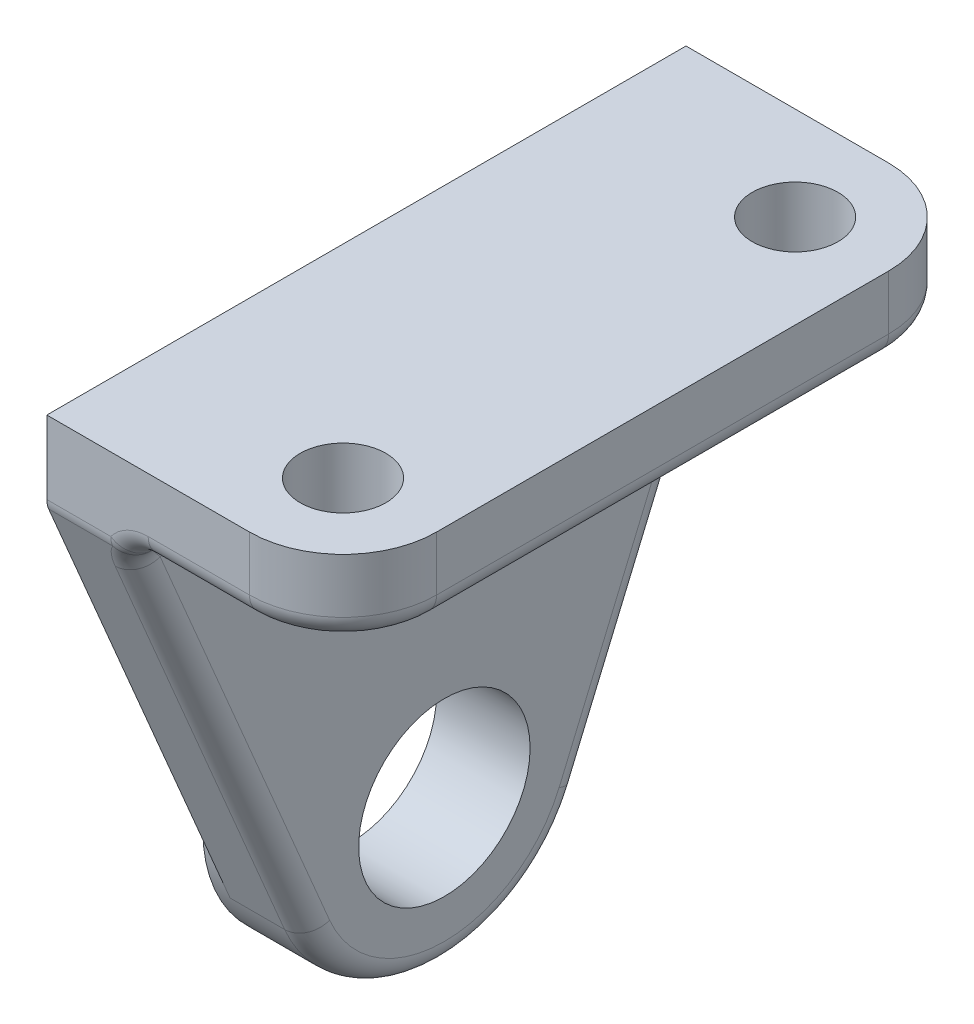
ISO-10303-21;
HEADER;
FILE_DESCRIPTION(('STEP AP214'),'2;1');
FILE_NAME('part.step','',(''),(''),'','','');
FILE_SCHEMA(('AUTOMOTIVE_DESIGN { 1 0 10303 214 1 1 1 1 }'));
ENDSEC;
DATA;
#1=APPLICATION_CONTEXT('core data for automotive mechanical design processes');
#2=APPLICATION_PROTOCOL_DEFINITION('international standard','automotive_design',2000,#1);
#3=PRODUCT_CONTEXT('',#1,'mechanical');
#4=PRODUCT('Part','Part','',(#3));
#5=PRODUCT_RELATED_PRODUCT_CATEGORY('part','',(#4));
#6=PRODUCT_DEFINITION_FORMATION('','',#4);
#7=PRODUCT_DEFINITION_CONTEXT('part definition',#1,'design');
#8=PRODUCT_DEFINITION('design','',#6,#7);
#9=PRODUCT_DEFINITION_SHAPE('','',#8);
#10=(LENGTH_UNIT() NAMED_UNIT(*) SI_UNIT(.MILLI.,.METRE.));
#11=(NAMED_UNIT(*) PLANE_ANGLE_UNIT() SI_UNIT($,.RADIAN.));
#12=(NAMED_UNIT(*) SI_UNIT($,.STERADIAN.) SOLID_ANGLE_UNIT());
#13=UNCERTAINTY_MEASURE_WITH_UNIT(LENGTH_MEASURE(1.E-05),#10,'distance_accuracy_value','');
#14=(GEOMETRIC_REPRESENTATION_CONTEXT(3) GLOBAL_UNCERTAINTY_ASSIGNED_CONTEXT((#13)) GLOBAL_UNIT_ASSIGNED_CONTEXT((#10,
#11,#12)) REPRESENTATION_CONTEXT('',''));
#15=CARTESIAN_POINT('',(0.,0.,0.));
#16=DIRECTION('',(0.,0.,1.));
#17=DIRECTION('',(1.,0.,0.));
#18=AXIS2_PLACEMENT_3D('',#15,#16,#17);
#19=CARTESIAN_POINT('',(-12.,0.,0.));
#20=DIRECTION('',(1.,0.,0.));
#21=DIRECTION('',(0.,0.,-1.));
#22=AXIS2_PLACEMENT_3D('',#19,#20,#21);
#23=CYLINDRICAL_SURFACE('',#22,19.);
#24=DIRECTION('',(1.,0.,0.));
#25=VECTOR('',#24,1.);
#26=CARTESIAN_POINT('',(-10.,-7.41970920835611,-17.4913668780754));
#27=LINE('',#26,#25);
#28=CARTESIAN_POINT('',(-10.,-7.41970920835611,-17.4913668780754));
#29=VERTEX_POINT('',#28);
#30=CARTESIAN_POINT('',(-3.,-7.41970920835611,-17.4913668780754));
#31=VERTEX_POINT('',#30);
#32=EDGE_CURVE('E200',#29,#31,#27,.T.);
#33=ORIENTED_EDGE('',*,*,#32,.T.);
#34=CARTESIAN_POINT('',(-3.,0.,0.));
#35=DIRECTION('',(1.,0.,0.));
#36=DIRECTION('',(0.,0.,-1.));
#37=AXIS2_PLACEMENT_3D('',#34,#35,#36);
#38=CIRCLE('',#37,19.);
#39=CARTESIAN_POINT('',(-3.,-7.41970920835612,17.4913668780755));
#40=VERTEX_POINT('',#39);
#41=EDGE_CURVE('E260',#31,#40,#38,.F.);
#42=ORIENTED_EDGE('',*,*,#41,.T.);
#43=DIRECTION('',(1.,0.,0.));
#44=VECTOR('',#43,1.);
#45=CARTESIAN_POINT('',(-10.,-7.41970920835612,17.4913668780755));
#46=LINE('',#45,#44);
#47=CARTESIAN_POINT('',(-10.,-7.41970920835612,17.4913668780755));
#48=VERTEX_POINT('',#47);
#49=EDGE_CURVE('E199',#48,#40,#46,.T.);
#50=ORIENTED_EDGE('',*,*,#49,.F.);
#51=CARTESIAN_POINT('',(-10.,0.,0.));
#52=DIRECTION('',(1.,0.,0.));
#53=DIRECTION('',(0.,0.,-1.));
#54=AXIS2_PLACEMENT_3D('',#51,#52,#53);
#55=CIRCLE('',#54,19.);
#56=EDGE_CURVE('E203',#48,#29,#55,.F.);
#57=ORIENTED_EDGE('',*,*,#56,.T.);
#58=EDGE_LOOP('',(#33,#42,#50,#57));
#59=FACE_BOUND('',#58,.T.);
#60=CARTESIAN_POINT('',(-12.,0.,0.));
#61=DIRECTION('',(1.,0.,0.));
#62=DIRECTION('',(0.,0.,-1.));
#63=AXIS2_PLACEMENT_3D('',#60,#61,#62);
#64=CIRCLE('',#63,19.);
#65=CARTESIAN_POINT('',(-12.,0.,-19.));
#66=VERTEX_POINT('',#65);
#67=EDGE_CURVE('E214',#66,#66,#64,.T.);
#68=ORIENTED_EDGE('',*,*,#67,.T.);
#69=EDGE_LOOP('',(#68));
#70=FACE_BOUND('',#69,.T.);
#71=ADVANCED_FACE('F34',(#59,#70),#23,.T.);
#72=CARTESIAN_POINT('',(-12.,0.,0.));
#73=DIRECTION('',(1.,0.,0.));
#74=DIRECTION('',(0.,0.,-1.));
#75=AXIS2_PLACEMENT_3D('',#72,#73,#74);
#76=PLANE('',#75);
#77=CARTESIAN_POINT('',(-12.,0.,0.));
#78=DIRECTION('',(1.,0.,0.));
#79=DIRECTION('',(0.,0.,-1.));
#80=AXIS2_PLACEMENT_3D('',#77,#78,#79);
#81=CIRCLE('',#80,11.);
#82=CARTESIAN_POINT('',(-12.,0.,-11.));
#83=VERTEX_POINT('',#82);
#84=EDGE_CURVE('E211',#83,#83,#81,.T.);
#85=ORIENTED_EDGE('',*,*,#84,.T.);
#86=EDGE_LOOP('',(#85));
#87=FACE_BOUND('',#86,.T.);
#88=ORIENTED_EDGE('',*,*,#67,.F.);
#89=EDGE_LOOP('',(#88));
#90=FACE_BOUND('',#89,.T.);
#91=ADVANCED_FACE('F447',(#87,#90),#76,.F.);
#92=CARTESIAN_POINT('',(0.,0.,0.));
#93=DIRECTION('',(1.,0.,0.));
#94=DIRECTION('',(0.,0.,-1.));
#95=AXIS2_PLACEMENT_3D('',#92,#93,#94);
#96=PLANE('',#95);
#97=CARTESIAN_POINT('',(0.,0.,0.));
#98=DIRECTION('',(1.,0.,0.));
#99=DIRECTION('',(0.,0.,-1.));
#100=AXIS2_PLACEMENT_3D('',#97,#98,#99);
#101=CIRCLE('',#100,11.);
#102=CARTESIAN_POINT('',(0.,0.,-11.));
#103=VERTEX_POINT('',#102);
#104=EDGE_CURVE('E208',#103,#103,#101,.T.);
#105=ORIENTED_EDGE('',*,*,#104,.F.);
#106=EDGE_LOOP('',(#105));
#107=FACE_BOUND('',#106,.T.);
#108=CARTESIAN_POINT('',(0.,0.,0.));
#109=DIRECTION('',(1.,0.,0.));
#110=DIRECTION('',(0.,0.,-1.));
#111=AXIS2_PLACEMENT_3D('',#108,#109,#110);
#112=CIRCLE('',#111,16.);
#113=CARTESIAN_POINT('',(0.,-6.24817617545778,14.729572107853));
#114=VERTEX_POINT('',#113);
#115=CARTESIAN_POINT('',(0.,-6.24817617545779,-14.729572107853));
#116=VERTEX_POINT('',#115);
#117=EDGE_CURVE('E256',#114,#116,#112,.T.);
#118=ORIENTED_EDGE('',*,*,#117,.T.);
#119=DIRECTION('',(0.,0.920598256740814,-0.390511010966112));
#120=VECTOR('',#119,1.);
#121=CARTESIAN_POINT('',(0.,-6.24817617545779,-14.729572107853));
#122=LINE('',#121,#120);
#123=CARTESIAN_POINT('',(0.,45.,-36.4686715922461));
#124=VERTEX_POINT('',#123);
#125=EDGE_CURVE('E258',#116,#124,#122,.T.);
#126=ORIENTED_EDGE('',*,*,#125,.T.);
#127=DIRECTION('',(0.,0.,1.));
#128=VECTOR('',#127,1.);
#129=CARTESIAN_POINT('',(0.,45.,41.));
#130=LINE('',#129,#128);
#131=CARTESIAN_POINT('',(0.,45.,36.4686715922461));
#132=VERTEX_POINT('',#131);
#133=EDGE_CURVE('E229',#124,#132,#130,.T.);
#134=ORIENTED_EDGE('',*,*,#133,.T.);
#135=DIRECTION('',(0.,-0.920598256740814,-0.390511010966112));
#136=VECTOR('',#135,1.);
#137=CARTESIAN_POINT('',(0.,-6.24817617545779,14.729572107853));
#138=LINE('',#137,#136);
#139=EDGE_CURVE('E254',#132,#114,#138,.T.);
#140=ORIENTED_EDGE('',*,*,#139,.T.);
#141=EDGE_LOOP('',(#118,#126,#134,#140));
#142=FACE_BOUND('',#141,.T.);
#143=ADVANCED_FACE('F452',(#107,#142),#96,.T.);
#144=CARTESIAN_POINT('',(-12.,0.,0.));
#145=DIRECTION('',(1.,0.,0.));
#146=DIRECTION('',(0.,0.,-1.));
#147=AXIS2_PLACEMENT_3D('',#144,#145,#146);
#148=CYLINDRICAL_SURFACE('',#147,11.);
#149=ORIENTED_EDGE('',*,*,#104,.T.);
#150=EDGE_LOOP('',(#149));
#151=FACE_BOUND('',#150,.T.);
#152=ORIENTED_EDGE('',*,*,#84,.F.);
#153=EDGE_LOOP('',(#152));
#154=FACE_BOUND('',#153,.T.);
#155=ADVANCED_FACE('F487',(#151,#154),#148,.F.);
#156=CARTESIAN_POINT('',(-10.,48.,-41.));
#157=DIRECTION('',(0.,-0.390511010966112,-0.920598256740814));
#158=DIRECTION('',(0.,0.920598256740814,-0.390511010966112));
#159=AXIS2_PLACEMENT_3D('',#156,#157,#158);
#160=PLANE('',#159);
#161=DIRECTION('',(0.,0.920598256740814,-0.390511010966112));
#162=VECTOR('',#161,1.);
#163=CARTESIAN_POINT('',(-10.,48.,-41.));
#164=LINE('',#163,#162);
#165=CARTESIAN_POINT('',(-10.,47.4384503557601,-40.7617947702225));
#166=VERTEX_POINT('',#165);
#167=EDGE_CURVE('E189',#29,#166,#164,.T.);
#168=ORIENTED_EDGE('',*,*,#167,.T.);
#169=DIRECTION('',(1.,0.,0.));
#170=VECTOR('',#169,1.);
#171=CARTESIAN_POINT('',(-2.19615242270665,47.4384503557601,-40.7617947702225));
#172=LINE('',#171,#170);
#173=CARTESIAN_POINT('',(-1.7924962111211,47.4384503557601,-40.7617947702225));
#174=VERTEX_POINT('',#173);
#175=EDGE_CURVE('E292',#166,#174,#172,.T.);
#176=ORIENTED_EDGE('',*,*,#175,.T.);
#177=CARTESIAN_POINT('',(3.,43.8284669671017,-39.2304663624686));
#178=DIRECTION('',(0.,-0.390511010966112,-0.920598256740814));
#179=DIRECTION('',(0.,0.920598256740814,-0.390511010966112));
#180=AXIS2_PLACEMENT_3D('',#177,#178,#179);
#181=ELLIPSE('',#180,6.5175009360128,6.);
#182=CARTESIAN_POINT('',(-3.,43.8284669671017,-39.2304663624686));
#183=VERTEX_POINT('',#182);
#184=EDGE_CURVE('E250',#174,#183,#181,.F.);
#185=ORIENTED_EDGE('',*,*,#184,.T.);
#186=DIRECTION('',(0.,0.920598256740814,-0.390511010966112));
#187=VECTOR('',#186,1.);
#188=CARTESIAN_POINT('',(-3.,48.,-41.));
#189=LINE('',#188,#187);
#190=EDGE_CURVE('E252',#183,#31,#189,.F.);
#191=ORIENTED_EDGE('',*,*,#190,.T.);
#192=ORIENTED_EDGE('',*,*,#32,.F.);
#193=EDGE_LOOP('',(#168,#176,#185,#191,#192));
#194=FACE_BOUND('',#193,.T.);
#195=ADVANCED_FACE('F373',(#194),#160,.T.);
#196=CARTESIAN_POINT('',(-10.,48.,41.));
#197=DIRECTION('',(0.,-0.390511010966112,0.920598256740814));
#198=DIRECTION('',(0.,-0.920598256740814,-0.390511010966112));
#199=AXIS2_PLACEMENT_3D('',#196,#197,#198);
#200=PLANE('',#199);
#201=CARTESIAN_POINT('',(3.,43.8284669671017,39.2304663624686));
#202=DIRECTION('',(0.,-0.390511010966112,0.920598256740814));
#203=DIRECTION('',(0.,-0.920598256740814,-0.390511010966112));
#204=AXIS2_PLACEMENT_3D('',#201,#202,#203);
#205=ELLIPSE('',#204,6.5175009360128,6.);
#206=CARTESIAN_POINT('',(-3.,43.8284669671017,39.2304663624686));
#207=VERTEX_POINT('',#206);
#208=CARTESIAN_POINT('',(-1.7924962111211,47.4384503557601,40.7617947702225));
#209=VERTEX_POINT('',#208);
#210=EDGE_CURVE('E235',#207,#209,#205,.F.);
#211=ORIENTED_EDGE('',*,*,#210,.T.);
#212=DIRECTION('',(1.,0.,0.));
#213=VECTOR('',#212,1.);
#214=CARTESIAN_POINT('',(-10.,47.4384503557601,40.7617947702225));
#215=LINE('',#214,#213);
#216=CARTESIAN_POINT('',(-10.,47.4384503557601,40.7617947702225));
#217=VERTEX_POINT('',#216);
#218=EDGE_CURVE('E11',#209,#217,#215,.F.);
#219=ORIENTED_EDGE('',*,*,#218,.T.);
#220=DIRECTION('',(0.,-0.920598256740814,-0.390511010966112));
#221=VECTOR('',#220,1.);
#222=CARTESIAN_POINT('',(-10.,48.,41.));
#223=LINE('',#222,#221);
#224=EDGE_CURVE('E192',#217,#48,#223,.T.);
#225=ORIENTED_EDGE('',*,*,#224,.T.);
#226=ORIENTED_EDGE('',*,*,#49,.T.);
#227=DIRECTION('',(0.,-0.920598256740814,-0.390511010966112));
#228=VECTOR('',#227,1.);
#229=CARTESIAN_POINT('',(-3.,48.,41.));
#230=LINE('',#229,#228);
#231=EDGE_CURVE('E237',#40,#207,#230,.F.);
#232=ORIENTED_EDGE('',*,*,#231,.T.);
#233=EDGE_LOOP('',(#211,#219,#225,#226,#232));
#234=FACE_BOUND('',#233,.T.);
#235=ADVANCED_FACE('F322',(#234),#200,.T.);
#236=CARTESIAN_POINT('',(-10.,0.,0.));
#237=DIRECTION('',(1.,0.,0.));
#238=DIRECTION('',(0.,0.,-1.));
#239=AXIS2_PLACEMENT_3D('',#236,#237,#238);
#240=PLANE('',#239);
#241=DIRECTION('',(0.,-1.,0.));
#242=VECTOR('',#241,1.);
#243=CARTESIAN_POINT('',(-10.,58.,-41.));
#244=LINE('',#243,#242);
#245=CARTESIAN_POINT('',(-10.,58.,-41.));
#246=VERTEX_POINT('',#245);
#247=CARTESIAN_POINT('',(-10.,48.6099833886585,-41.));
#248=VERTEX_POINT('',#247);
#249=EDGE_CURVE('E179',#246,#248,#244,.T.);
#250=ORIENTED_EDGE('',*,*,#249,.T.);
#251=CARTESIAN_POINT('',(-10.,48.6099833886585,-38.));
#252=DIRECTION('',(1.,0.,0.));
#253=DIRECTION('',(0.,0.,-1.));
#254=AXIS2_PLACEMENT_3D('',#251,#252,#253);
#255=CIRCLE('',#254,3.);
#256=EDGE_CURVE('E296',#248,#166,#255,.F.);
#257=ORIENTED_EDGE('',*,*,#256,.T.);
#258=ORIENTED_EDGE('',*,*,#167,.F.);
#259=ORIENTED_EDGE('',*,*,#56,.F.);
#260=ORIENTED_EDGE('',*,*,#224,.F.);
#261=CARTESIAN_POINT('',(-10.,48.6099833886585,38.));
#262=DIRECTION('',(1.,0.,0.));
#263=DIRECTION('',(0.,0.,-1.));
#264=AXIS2_PLACEMENT_3D('',#261,#262,#263);
#265=CIRCLE('',#264,3.);
#266=CARTESIAN_POINT('',(-10.,48.6099833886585,41.));
#267=VERTEX_POINT('',#266);
#268=EDGE_CURVE('E48',#217,#267,#265,.F.);
#269=ORIENTED_EDGE('',*,*,#268,.T.);
#270=DIRECTION('',(0.,-1.,0.));
#271=VECTOR('',#270,1.);
#272=CARTESIAN_POINT('',(-10.,58.,41.));
#273=LINE('',#272,#271);
#274=CARTESIAN_POINT('',(-10.,58.,41.));
#275=VERTEX_POINT('',#274);
#276=EDGE_CURVE('E181',#275,#267,#273,.T.);
#277=ORIENTED_EDGE('',*,*,#276,.F.);
#278=DIRECTION('',(0.,0.,1.));
#279=VECTOR('',#278,1.);
#280=CARTESIAN_POINT('',(-10.,58.,-41.));
#281=LINE('',#280,#279);
#282=EDGE_CURVE('E168',#246,#275,#281,.T.);
#283=ORIENTED_EDGE('',*,*,#282,.F.);
#284=EDGE_LOOP('',(#250,#257,#258,#259,#260,#269,#277,#283));
#285=FACE_BOUND('',#284,.T.);
#286=ADVANCED_FACE('F178',(#285),#240,.F.);
#287=CARTESIAN_POINT('',(28.,48.,-41.));
#288=DIRECTION('',(0.,-1.,0.));
#289=DIRECTION('',(0.,0.,-1.));
#290=AXIS2_PLACEMENT_3D('',#287,#288,#289);
#291=PLANE('',#290);
#292=DIRECTION('',(0.,0.,1.));
#293=VECTOR('',#292,1.);
#294=CARTESIAN_POINT('',(3.,48.,-41.));
#295=LINE('',#294,#293);
#296=CARTESIAN_POINT('',(3.,48.,38.));
#297=VERTEX_POINT('',#296);
#298=CARTESIAN_POINT('',(3.,48.,-38.));
#299=VERTEX_POINT('',#298);
#300=EDGE_CURVE('E232',#297,#299,#295,.F.);
#301=ORIENTED_EDGE('',*,*,#300,.T.);
#302=DIRECTION('',(-1.,0.,0.));
#303=VECTOR('',#302,1.);
#304=CARTESIAN_POINT('',(16.,48.,-38.));
#305=LINE('',#304,#303);
#306=CARTESIAN_POINT('',(16.,48.,-38.));
#307=VERTEX_POINT('',#306);
#308=EDGE_CURVE('E270',#299,#307,#305,.F.);
#309=ORIENTED_EDGE('',*,*,#308,.T.);
#310=CARTESIAN_POINT('',(16.,48.,-29.));
#311=DIRECTION('',(0.,-1.,0.));
#312=DIRECTION('',(0.,0.,-1.));
#313=AXIS2_PLACEMENT_3D('',#310,#311,#312);
#314=CIRCLE('',#313,9.);
#315=CARTESIAN_POINT('',(25.,48.,-29.));
#316=VERTEX_POINT('',#315);
#317=EDGE_CURVE('E787',#316,#307,#314,.T.);
#318=ORIENTED_EDGE('',*,*,#317,.F.);
#319=DIRECTION('',(0.,0.,-1.));
#320=VECTOR('',#319,1.);
#321=CARTESIAN_POINT('',(25.,48.,29.));
#322=LINE('',#321,#320);
#323=CARTESIAN_POINT('',(25.,48.,29.));
#324=VERTEX_POINT('',#323);
#325=EDGE_CURVE('E268',#316,#324,#322,.F.);
#326=ORIENTED_EDGE('',*,*,#325,.T.);
#327=CARTESIAN_POINT('',(16.,48.,29.));
#328=DIRECTION('',(0.,-1.,0.));
#329=DIRECTION('',(0.,0.,-1.));
#330=AXIS2_PLACEMENT_3D('',#327,#328,#329);
#331=CIRCLE('',#330,9.);
#332=CARTESIAN_POINT('',(16.,48.,38.));
#333=VERTEX_POINT('',#332);
#334=EDGE_CURVE('E776',#333,#324,#331,.T.);
#335=ORIENTED_EDGE('',*,*,#334,.F.);
#336=DIRECTION('',(1.,0.,0.));
#337=VECTOR('',#336,1.);
#338=CARTESIAN_POINT('',(3.,48.,38.));
#339=LINE('',#338,#337);
#340=EDGE_CURVE('E266',#333,#297,#339,.F.);
#341=ORIENTED_EDGE('',*,*,#340,.T.);
#342=EDGE_LOOP('',(#301,#309,#318,#326,#335,#341));
#343=FACE_BOUND('',#342,.T.);
#344=ADVANCED_FACE('F399',(#343),#291,.T.);
#345=CARTESIAN_POINT('',(-10.,58.,-41.));
#346=DIRECTION('',(0.,0.,1.));
#347=DIRECTION('',(1.,0.,0.));
#348=AXIS2_PLACEMENT_3D('',#345,#346,#347);
#349=PLANE('',#348);
#350=CARTESIAN_POINT('',(3.,45.,-41.));
#351=DIRECTION('',(0.,0.,1.));
#352=DIRECTION('',(1.,0.,0.));
#353=AXIS2_PLACEMENT_3D('',#350,#351,#352);
#354=CIRCLE('',#353,6.);
#355=CARTESIAN_POINT('',(3.,51.,-41.));
#356=VERTEX_POINT('',#355);
#357=CARTESIAN_POINT('',(-1.7924962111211,48.6099833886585,-41.));
#358=VERTEX_POINT('',#357);
#359=EDGE_CURVE('E262',#356,#358,#354,.T.);
#360=ORIENTED_EDGE('',*,*,#359,.T.);
#361=DIRECTION('',(1.,0.,0.));
#362=VECTOR('',#361,1.);
#363=CARTESIAN_POINT('',(-10.,48.6099833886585,-41.));
#364=LINE('',#363,#362);
#365=EDGE_CURVE('E188',#358,#248,#364,.F.);
#366=ORIENTED_EDGE('',*,*,#365,.T.);
#367=ORIENTED_EDGE('',*,*,#249,.F.);
#368=DIRECTION('',(-1.,0.,0.));
#369=VECTOR('',#368,1.);
#370=CARTESIAN_POINT('',(-10.,58.,-41.));
#371=LINE('',#370,#369);
#372=CARTESIAN_POINT('',(16.,58.,-41.));
#373=VERTEX_POINT('',#372);
#374=EDGE_CURVE('E163',#373,#246,#371,.T.);
#375=ORIENTED_EDGE('',*,*,#374,.F.);
#376=DIRECTION('',(0.,-1.,0.));
#377=VECTOR('',#376,1.);
#378=CARTESIAN_POINT('',(16.,58.,-41.));
#379=LINE('',#378,#377);
#380=CARTESIAN_POINT('',(16.,51.,-41.));
#381=VERTEX_POINT('',#380);
#382=EDGE_CURVE('E217',#373,#381,#379,.T.);
#383=ORIENTED_EDGE('',*,*,#382,.T.);
#384=DIRECTION('',(-1.,0.,0.));
#385=VECTOR('',#384,1.);
#386=CARTESIAN_POINT('',(3.,51.,-41.));
#387=LINE('',#386,#385);
#388=EDGE_CURVE('E264',#381,#356,#387,.T.);
#389=ORIENTED_EDGE('',*,*,#388,.T.);
#390=EDGE_LOOP('',(#360,#366,#367,#375,#383,#389));
#391=FACE_BOUND('',#390,.T.);
#392=ADVANCED_FACE('F186',(#391),#349,.F.);
#393=CARTESIAN_POINT('',(-10.,58.,41.));
#394=DIRECTION('',(0.,0.,-1.));
#395=DIRECTION('',(-1.,0.,0.));
#396=AXIS2_PLACEMENT_3D('',#393,#394,#395);
#397=PLANE('',#396);
#398=ORIENTED_EDGE('',*,*,#276,.T.);
#399=DIRECTION('',(1.,0.,0.));
#400=VECTOR('',#399,1.);
#401=CARTESIAN_POINT('',(-2.19615242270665,48.6099833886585,41.));
#402=LINE('',#401,#400);
#403=CARTESIAN_POINT('',(-1.7924962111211,48.6099833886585,41.));
#404=VERTEX_POINT('',#403);
#405=EDGE_CURVE('E41',#267,#404,#402,.T.);
#406=ORIENTED_EDGE('',*,*,#405,.T.);
#407=CARTESIAN_POINT('',(3.,45.,41.));
#408=DIRECTION('',(0.,0.,-1.));
#409=DIRECTION('',(-1.,0.,0.));
#410=AXIS2_PLACEMENT_3D('',#407,#408,#409);
#411=CIRCLE('',#410,6.);
#412=CARTESIAN_POINT('',(3.,51.,41.));
#413=VERTEX_POINT('',#412);
#414=EDGE_CURVE('E280',#404,#413,#411,.T.);
#415=ORIENTED_EDGE('',*,*,#414,.T.);
#416=DIRECTION('',(1.,0.,0.));
#417=VECTOR('',#416,1.);
#418=CARTESIAN_POINT('',(16.,51.,41.));
#419=LINE('',#418,#417);
#420=CARTESIAN_POINT('',(16.,51.,41.));
#421=VERTEX_POINT('',#420);
#422=EDGE_CURVE('E278',#413,#421,#419,.T.);
#423=ORIENTED_EDGE('',*,*,#422,.T.);
#424=DIRECTION('',(0.,-1.,0.));
#425=VECTOR('',#424,1.);
#426=CARTESIAN_POINT('',(16.,58.,41.));
#427=LINE('',#426,#425);
#428=CARTESIAN_POINT('',(16.,58.,41.));
#429=VERTEX_POINT('',#428);
#430=EDGE_CURVE('E227',#421,#429,#427,.F.);
#431=ORIENTED_EDGE('',*,*,#430,.T.);
#432=DIRECTION('',(1.,0.,0.));
#433=VECTOR('',#432,1.);
#434=CARTESIAN_POINT('',(-10.,58.,41.));
#435=LINE('',#434,#433);
#436=EDGE_CURVE('E183',#275,#429,#435,.T.);
#437=ORIENTED_EDGE('',*,*,#436,.F.);
#438=EDGE_LOOP('',(#398,#406,#415,#423,#431,#437));
#439=FACE_BOUND('',#438,.T.);
#440=ADVANCED_FACE('F300',(#439),#397,.F.);
#441=CARTESIAN_POINT('',(28.,58.,-41.));
#442=DIRECTION('',(-1.,0.,0.));
#443=DIRECTION('',(0.,0.,1.));
#444=AXIS2_PLACEMENT_3D('',#441,#442,#443);
#445=PLANE('',#444);
#446=DIRECTION('',(0.,-1.,0.));
#447=VECTOR('',#446,1.);
#448=CARTESIAN_POINT('',(28.,58.,29.));
#449=LINE('',#448,#447);
#450=CARTESIAN_POINT('',(28.,58.,29.));
#451=VERTEX_POINT('',#450);
#452=CARTESIAN_POINT('',(28.,51.,29.));
#453=VERTEX_POINT('',#452);
#454=EDGE_CURVE('E219',#451,#453,#449,.T.);
#455=ORIENTED_EDGE('',*,*,#454,.T.);
#456=DIRECTION('',(0.,0.,-1.));
#457=VECTOR('',#456,1.);
#458=CARTESIAN_POINT('',(28.,51.,-29.));
#459=LINE('',#458,#457);
#460=CARTESIAN_POINT('',(28.,51.,-29.));
#461=VERTEX_POINT('',#460);
#462=EDGE_CURVE('E274',#453,#461,#459,.T.);
#463=ORIENTED_EDGE('',*,*,#462,.T.);
#464=DIRECTION('',(0.,-1.,0.));
#465=VECTOR('',#464,1.);
#466=CARTESIAN_POINT('',(28.,58.,-29.));
#467=LINE('',#466,#465);
#468=CARTESIAN_POINT('',(28.,58.,-29.));
#469=VERTEX_POINT('',#468);
#470=EDGE_CURVE('E222',#461,#469,#467,.F.);
#471=ORIENTED_EDGE('',*,*,#470,.T.);
#472=DIRECTION('',(0.,0.,-1.));
#473=VECTOR('',#472,1.);
#474=CARTESIAN_POINT('',(28.,58.,-41.));
#475=LINE('',#474,#473);
#476=EDGE_CURVE('E194',#451,#469,#475,.T.);
#477=ORIENTED_EDGE('',*,*,#476,.F.);
#478=EDGE_LOOP('',(#455,#463,#471,#477));
#479=FACE_BOUND('',#478,.T.);
#480=ADVANCED_FACE('F404',(#479),#445,.F.);
#481=CARTESIAN_POINT('',(28.,58.,-41.));
#482=DIRECTION('',(0.,-1.,0.));
#483=DIRECTION('',(0.,0.,-1.));
#484=AXIS2_PLACEMENT_3D('',#481,#482,#483);
#485=PLANE('',#484);
#486=CARTESIAN_POINT('',(16.,58.,29.));
#487=DIRECTION('',(0.,-1.,0.));
#488=DIRECTION('',(0.,0.,-1.));
#489=AXIS2_PLACEMENT_3D('',#486,#487,#488);
#490=CIRCLE('',#489,5.50000000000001);
#491=CARTESIAN_POINT('',(16.,58.,23.5));
#492=VERTEX_POINT('',#491);
#493=EDGE_CURVE('E766',#492,#492,#490,.T.);
#494=ORIENTED_EDGE('',*,*,#493,.T.);
#495=EDGE_LOOP('',(#494));
#496=FACE_BOUND('',#495,.T.);
#497=CARTESIAN_POINT('',(16.,58.,-29.));
#498=DIRECTION('',(0.,-1.,0.));
#499=DIRECTION('',(0.,0.,-1.));
#500=AXIS2_PLACEMENT_3D('',#497,#498,#499);
#501=CIRCLE('',#500,5.50000000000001);
#502=CARTESIAN_POINT('',(16.,58.,-34.5));
#503=VERTEX_POINT('',#502);
#504=EDGE_CURVE('E778',#503,#503,#501,.T.);
#505=ORIENTED_EDGE('',*,*,#504,.T.);
#506=EDGE_LOOP('',(#505));
#507=FACE_BOUND('',#506,.T.);
#508=ORIENTED_EDGE('',*,*,#476,.T.);
#509=CARTESIAN_POINT('',(16.,58.,-29.));
#510=DIRECTION('',(0.,-1.,0.));
#511=DIRECTION('',(0.,0.,-1.));
#512=AXIS2_PLACEMENT_3D('',#509,#510,#511);
#513=CIRCLE('',#512,12.);
#514=EDGE_CURVE('E170',#469,#373,#513,.F.);
#515=ORIENTED_EDGE('',*,*,#514,.T.);
#516=ORIENTED_EDGE('',*,*,#374,.T.);
#517=ORIENTED_EDGE('',*,*,#282,.T.);
#518=ORIENTED_EDGE('',*,*,#436,.T.);
#519=CARTESIAN_POINT('',(16.,58.,29.));
#520=DIRECTION('',(0.,-1.,0.));
#521=DIRECTION('',(0.,0.,-1.));
#522=AXIS2_PLACEMENT_3D('',#519,#520,#521);
#523=CIRCLE('',#522,12.);
#524=EDGE_CURVE('E224',#429,#451,#523,.F.);
#525=ORIENTED_EDGE('',*,*,#524,.T.);
#526=EDGE_LOOP('',(#508,#515,#516,#517,#518,#525));
#527=FACE_BOUND('',#526,.T.);
#528=ADVANCED_FACE('F166',(#496,#507,#527),#485,.F.);
#529=CARTESIAN_POINT('',(16.,58.,-29.));
#530=DIRECTION('',(0.,-1.,0.));
#531=DIRECTION('',(0.,0.,-1.));
#532=AXIS2_PLACEMENT_3D('',#529,#530,#531);
#533=CYLINDRICAL_SURFACE('',#532,12.);
#534=ORIENTED_EDGE('',*,*,#470,.F.);
#535=CARTESIAN_POINT('',(16.,51.,-29.));
#536=DIRECTION('',(0.,-1.,0.));
#537=DIRECTION('',(0.,0.,-1.));
#538=AXIS2_PLACEMENT_3D('',#535,#536,#537);
#539=CIRCLE('',#538,12.);
#540=EDGE_CURVE('E272',#461,#381,#539,.F.);
#541=ORIENTED_EDGE('',*,*,#540,.T.);
#542=ORIENTED_EDGE('',*,*,#382,.F.);
#543=ORIENTED_EDGE('',*,*,#514,.F.);
#544=EDGE_LOOP('',(#534,#541,#542,#543));
#545=FACE_BOUND('',#544,.T.);
#546=ADVANCED_FACE('F410',(#545),#533,.T.);
#547=CARTESIAN_POINT('',(16.,58.,29.));
#548=DIRECTION('',(0.,-1.,0.));
#549=DIRECTION('',(0.,0.,-1.));
#550=AXIS2_PLACEMENT_3D('',#547,#548,#549);
#551=CYLINDRICAL_SURFACE('',#550,12.);
#552=ORIENTED_EDGE('',*,*,#430,.F.);
#553=CARTESIAN_POINT('',(16.,51.,29.));
#554=DIRECTION('',(0.,-1.,0.));
#555=DIRECTION('',(0.,0.,-1.));
#556=AXIS2_PLACEMENT_3D('',#553,#554,#555);
#557=CIRCLE('',#556,12.);
#558=EDGE_CURVE('E276',#421,#453,#557,.F.);
#559=ORIENTED_EDGE('',*,*,#558,.T.);
#560=ORIENTED_EDGE('',*,*,#454,.F.);
#561=ORIENTED_EDGE('',*,*,#524,.F.);
#562=EDGE_LOOP('',(#552,#559,#560,#561));
#563=FACE_BOUND('',#562,.T.);
#564=ADVANCED_FACE('F417',(#563),#551,.T.);
#565=CARTESIAN_POINT('',(16.,48.,-29.));
#566=DIRECTION('',(0.,-1.,0.));
#567=DIRECTION('',(0.,0.,-1.));
#568=AXIS2_PLACEMENT_3D('',#565,#566,#567);
#569=CYLINDRICAL_SURFACE('',#568,9.);
#570=CARTESIAN_POINT('',(16.,50.,-29.));
#571=DIRECTION('',(0.,-1.,0.));
#572=DIRECTION('',(0.,0.,-1.));
#573=AXIS2_PLACEMENT_3D('',#570,#571,#572);
#574=CIRCLE('',#573,9.);
#575=CARTESIAN_POINT('',(16.,50.,-38.));
#576=VERTEX_POINT('',#575);
#577=EDGE_CURVE('E784',#576,#576,#574,.T.);
#578=ORIENTED_EDGE('',*,*,#577,.F.);
#579=EDGE_LOOP('',(#578));
#580=FACE_BOUND('',#579,.T.);
#581=EDGE_CURVE('E175',#307,#316,#314,.T.);
#582=ORIENTED_EDGE('',*,*,#581,.T.);
#583=ORIENTED_EDGE('',*,*,#317,.T.);
#584=EDGE_LOOP('',(#582,#583));
#585=FACE_BOUND('',#584,.T.);
#586=ADVANCED_FACE('F421',(#580,#585),#569,.F.);
#587=CARTESIAN_POINT('',(21.5,50.,-29.));
#588=DIRECTION('',(0.,1.,0.));
#589=DIRECTION('',(0.,0.,1.));
#590=AXIS2_PLACEMENT_3D('',#587,#588,#589);
#591=PLANE('',#590);
#592=CARTESIAN_POINT('',(16.,50.,-29.));
#593=DIRECTION('',(0.,-1.,0.));
#594=DIRECTION('',(0.,0.,-1.));
#595=AXIS2_PLACEMENT_3D('',#592,#593,#594);
#596=CIRCLE('',#595,5.5);
#597=CARTESIAN_POINT('',(16.,50.,-34.5));
#598=VERTEX_POINT('',#597);
#599=EDGE_CURVE('E781',#598,#598,#596,.T.);
#600=ORIENTED_EDGE('',*,*,#599,.F.);
#601=EDGE_LOOP('',(#600));
#602=FACE_BOUND('',#601,.T.);
#603=ORIENTED_EDGE('',*,*,#577,.T.);
#604=EDGE_LOOP('',(#603));
#605=FACE_BOUND('',#604,.T.);
#606=ADVANCED_FACE('F425',(#602,#605),#591,.F.);
#607=CARTESIAN_POINT('',(16.,48.,-29.));
#608=DIRECTION('',(0.,-1.,0.));
#609=DIRECTION('',(0.,0.,-1.));
#610=AXIS2_PLACEMENT_3D('',#607,#608,#609);
#611=CYLINDRICAL_SURFACE('',#610,5.5);
#612=ORIENTED_EDGE('',*,*,#504,.F.);
#613=EDGE_LOOP('',(#612));
#614=FACE_BOUND('',#613,.T.);
#615=ORIENTED_EDGE('',*,*,#599,.T.);
#616=EDGE_LOOP('',(#615));
#617=FACE_BOUND('',#616,.T.);
#618=ADVANCED_FACE('F429',(#614,#617),#611,.F.);
#619=CARTESIAN_POINT('',(16.,48.,29.));
#620=DIRECTION('',(0.,-1.,0.));
#621=DIRECTION('',(0.,0.,-1.));
#622=AXIS2_PLACEMENT_3D('',#619,#620,#621);
#623=CYLINDRICAL_SURFACE('',#622,9.);
#624=CARTESIAN_POINT('',(16.,50.,29.));
#625=DIRECTION('',(0.,-1.,0.));
#626=DIRECTION('',(0.,0.,-1.));
#627=AXIS2_PLACEMENT_3D('',#624,#625,#626);
#628=CIRCLE('',#627,9.);
#629=CARTESIAN_POINT('',(16.,50.,20.));
#630=VERTEX_POINT('',#629);
#631=EDGE_CURVE('E773',#630,#630,#628,.T.);
#632=ORIENTED_EDGE('',*,*,#631,.F.);
#633=EDGE_LOOP('',(#632));
#634=FACE_BOUND('',#633,.T.);
#635=EDGE_CURVE('E749',#324,#333,#331,.T.);
#636=ORIENTED_EDGE('',*,*,#635,.T.);
#637=ORIENTED_EDGE('',*,*,#334,.T.);
#638=EDGE_LOOP('',(#636,#637));
#639=FACE_BOUND('',#638,.T.);
#640=ADVANCED_FACE('F433',(#634,#639),#623,.F.);
#641=CARTESIAN_POINT('',(21.5,50.,29.));
#642=DIRECTION('',(0.,1.,0.));
#643=DIRECTION('',(0.,0.,1.));
#644=AXIS2_PLACEMENT_3D('',#641,#642,#643);
#645=PLANE('',#644);
#646=CARTESIAN_POINT('',(16.,50.,29.));
#647=DIRECTION('',(0.,-1.,0.));
#648=DIRECTION('',(0.,0.,-1.));
#649=AXIS2_PLACEMENT_3D('',#646,#647,#648);
#650=CIRCLE('',#649,5.5);
#651=CARTESIAN_POINT('',(16.,50.,23.5));
#652=VERTEX_POINT('',#651);
#653=EDGE_CURVE('E768',#652,#652,#650,.T.);
#654=ORIENTED_EDGE('',*,*,#653,.F.);
#655=EDGE_LOOP('',(#654));
#656=FACE_BOUND('',#655,.T.);
#657=ORIENTED_EDGE('',*,*,#631,.T.);
#658=EDGE_LOOP('',(#657));
#659=FACE_BOUND('',#658,.T.);
#660=ADVANCED_FACE('F436',(#656,#659),#645,.F.);
#661=CARTESIAN_POINT('',(16.,48.,29.));
#662=DIRECTION('',(0.,-1.,0.));
#663=DIRECTION('',(0.,0.,-1.));
#664=AXIS2_PLACEMENT_3D('',#661,#662,#663);
#665=CYLINDRICAL_SURFACE('',#664,5.5);
#666=ORIENTED_EDGE('',*,*,#493,.F.);
#667=EDGE_LOOP('',(#666));
#668=FACE_BOUND('',#667,.T.);
#669=ORIENTED_EDGE('',*,*,#653,.T.);
#670=EDGE_LOOP('',(#669));
#671=FACE_BOUND('',#670,.T.);
#672=ADVANCED_FACE('F383',(#668,#671),#665,.F.);
#673=CARTESIAN_POINT('',(3.,45.,0.));
#674=DIRECTION('',(0.,0.,-1.));
#675=DIRECTION('',(-1.,0.,0.));
#676=AXIS2_PLACEMENT_3D('',#673,#674,#675);
#677=CYLINDRICAL_SURFACE('',#676,3.);
#678=ORIENTED_EDGE('',*,*,#133,.F.);
#679=CARTESIAN_POINT('',(3.,45.,-36.4686715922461));
#680=DIRECTION('',(0.,0.646933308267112,0.762546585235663));
#681=DIRECTION('',(0.,0.762546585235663,-0.646933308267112));
#682=AXIS2_PLACEMENT_3D('',#679,#680,#681);
#683=ELLIPSE('',#682,3.93418586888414,3.);
#684=CARTESIAN_POINT('',(0.603751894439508,46.8049916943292,-38.));
#685=VERTEX_POINT('',#684);
#686=EDGE_CURVE('E247',#124,#685,#683,.F.);
#687=ORIENTED_EDGE('',*,*,#686,.T.);
#688=CARTESIAN_POINT('',(3.,45.,-38.));
#689=DIRECTION('',(0.,0.,1.));
#690=DIRECTION('',(1.,0.,0.));
#691=AXIS2_PLACEMENT_3D('',#688,#689,#690);
#692=CIRCLE('',#691,3.);
#693=EDGE_CURVE('E245',#685,#299,#692,.F.);
#694=ORIENTED_EDGE('',*,*,#693,.T.);
#695=ORIENTED_EDGE('',*,*,#300,.F.);
#696=CARTESIAN_POINT('',(3.,45.,38.));
#697=DIRECTION('',(0.,0.,-1.));
#698=DIRECTION('',(-1.,0.,0.));
#699=AXIS2_PLACEMENT_3D('',#696,#697,#698);
#700=CIRCLE('',#699,3.);
#701=CARTESIAN_POINT('',(0.603751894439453,46.8049916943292,38.));
#702=VERTEX_POINT('',#701);
#703=EDGE_CURVE('E239',#297,#702,#700,.F.);
#704=ORIENTED_EDGE('',*,*,#703,.T.);
#705=CARTESIAN_POINT('',(3.,45.,36.4686715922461));
#706=DIRECTION('',(0.,0.646933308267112,-0.762546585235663));
#707=DIRECTION('',(0.,-0.762546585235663,-0.646933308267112));
#708=AXIS2_PLACEMENT_3D('',#705,#706,#707);
#709=ELLIPSE('',#708,3.93418586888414,3.);
#710=EDGE_CURVE('E242',#702,#132,#709,.F.);
#711=ORIENTED_EDGE('',*,*,#710,.T.);
#712=EDGE_LOOP('',(#678,#687,#694,#695,#704,#711));
#713=FACE_BOUND('',#712,.T.);
#714=ADVANCED_FACE('F377',(#713),#677,.F.);
#715=CARTESIAN_POINT('',(-10.,51.,-38.));
#716=DIRECTION('',(1.,0.,0.));
#717=DIRECTION('',(0.,0.,-1.));
#718=AXIS2_PLACEMENT_3D('',#715,#716,#717);
#719=CYLINDRICAL_SURFACE('',#718,3.);
#720=CARTESIAN_POINT('',(16.,51.,-38.));
#721=DIRECTION('',(1.,0.,0.));
#722=DIRECTION('',(0.,0.,-1.));
#723=AXIS2_PLACEMENT_3D('',#720,#721,#722);
#724=CIRCLE('',#723,3.);
#725=EDGE_CURVE('E356',#307,#381,#724,.T.);
#726=ORIENTED_EDGE('',*,*,#725,.F.);
#727=ORIENTED_EDGE('',*,*,#308,.F.);
#728=CARTESIAN_POINT('',(3.,51.,-38.));
#729=DIRECTION('',(-1.,0.,0.));
#730=DIRECTION('',(0.,0.,1.));
#731=AXIS2_PLACEMENT_3D('',#728,#729,#730);
#732=CIRCLE('',#731,3.);
#733=EDGE_CURVE('E765',#356,#299,#732,.T.);
#734=ORIENTED_EDGE('',*,*,#733,.F.);
#735=ORIENTED_EDGE('',*,*,#388,.F.);
#736=EDGE_LOOP('',(#726,#727,#734,#735));
#737=FACE_BOUND('',#736,.T.);
#738=ADVANCED_FACE('F382',(#737),#719,.T.);
#739=CARTESIAN_POINT('',(3.,45.,-38.));
#740=DIRECTION('',(0.,0.,1.));
#741=DIRECTION('',(1.,0.,0.));
#742=AXIS2_PLACEMENT_3D('',#739,#740,#741);
#743=TOROIDAL_SURFACE('',#742,6.,3.);
#744=ORIENTED_EDGE('',*,*,#693,.F.);
#745=CARTESIAN_POINT('',(-1.7924962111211,48.6099833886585,-38.));
#746=DIRECTION('',(-0.601663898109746,-0.798749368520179,0.));
#747=DIRECTION('',(0.79874936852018,-0.601663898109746,0.));
#748=AXIS2_PLACEMENT_3D('',#745,#746,#747);
#749=CIRCLE('',#748,3.);
#750=EDGE_CURVE('E285',#685,#358,#749,.F.);
#751=ORIENTED_EDGE('',*,*,#750,.T.);
#752=ORIENTED_EDGE('',*,*,#359,.F.);
#753=ORIENTED_EDGE('',*,*,#733,.T.);
#754=EDGE_LOOP('',(#744,#751,#752,#753));
#755=FACE_BOUND('',#754,.T.);
#756=ADVANCED_FACE('F371',(#755),#743,.T.);
#757=CARTESIAN_POINT('',(16.,51.,-29.));
#758=DIRECTION('',(0.,-1.,0.));
#759=DIRECTION('',(0.,0.,-1.));
#760=AXIS2_PLACEMENT_3D('',#757,#758,#759);
#761=TOROIDAL_SURFACE('',#760,9.,3.);
#762=ORIENTED_EDGE('',*,*,#725,.T.);
#763=ORIENTED_EDGE('',*,*,#540,.F.);
#764=CARTESIAN_POINT('',(25.,51.,-29.));
#765=DIRECTION('',(0.,0.,1.));
#766=DIRECTION('',(1.,0.,0.));
#767=AXIS2_PLACEMENT_3D('',#764,#765,#766);
#768=CIRCLE('',#767,3.);
#769=EDGE_CURVE('E353',#316,#461,#768,.T.);
#770=ORIENTED_EDGE('',*,*,#769,.F.);
#771=ORIENTED_EDGE('',*,*,#581,.F.);
#772=EDGE_LOOP('',(#762,#763,#770,#771));
#773=FACE_BOUND('',#772,.T.);
#774=ADVANCED_FACE('F368',(#773),#761,.T.);
#775=CARTESIAN_POINT('',(3.,49.8284669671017,-41.7756222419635));
#776=CARTESIAN_POINT('',(3.,48.,-41.));
#777=CARTESIAN_POINT('',(3.,48.,-39.0138274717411));
#778=CARTESIAN_POINT('',(3.26193212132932,49.8284669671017,-41.7756222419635));
#779=CARTESIAN_POINT('',(3.16774512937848,48.,-41.));
#780=CARTESIAN_POINT('',(3.13096606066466,48.,-39.0138274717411));
#781=CARTESIAN_POINT('',(3.52386424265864,49.8112722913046,-41.76832838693));
#782=CARTESIAN_POINT('',(3.33562523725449,47.9865430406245,-40.9942916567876));
#783=CARTESIAN_POINT('',(3.26193212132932,47.9914026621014,-39.0065336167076));
#784=CARTESIAN_POINT('',(4.04323636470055,49.7428964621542,-41.7393238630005));
#785=CARTESIAN_POINT('',(3.66688445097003,47.9332253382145,-40.9716746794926));
#786=CARTESIAN_POINT('',(3.52161818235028,47.9572147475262,-38.977529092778));
#787=CARTESIAN_POINT('',(4.30066033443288,49.6916124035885,-41.71756954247));
#788=CARTESIAN_POINT('',(3.83050539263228,47.8931993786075,-40.9546959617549));
#789=CARTESIAN_POINT('',(3.65033016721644,47.9315727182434,-38.9557747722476));
#790=CARTESIAN_POINT('',(4.80663502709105,49.5560384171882,-41.6600600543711));
#791=CARTESIAN_POINT('',(4.1491731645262,47.7879148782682,-40.9100350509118));
#792=CARTESIAN_POINT('',(3.90331751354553,47.8637857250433,-38.8982652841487));
#793=CARTESIAN_POINT('',(5.0551254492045,49.471558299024,-41.6242242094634));
#794=CARTESIAN_POINT('',(4.30438238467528,47.7223476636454,-40.8822219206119));
#795=CARTESIAN_POINT('',(4.02756272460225,47.8215456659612,-38.862429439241));
#796=CARTESIAN_POINT('',(5.53903229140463,49.2711196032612,-41.5391995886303));
#797=CARTESIAN_POINT('',(4.60240287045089,47.5677751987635,-40.8166534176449));
#798=CARTESIAN_POINT('',(4.26951614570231,47.7213263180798,-38.7774048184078));
#799=CARTESIAN_POINT('',(5.77432617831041,49.154911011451,-41.4899047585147));
#800=CARTESIAN_POINT('',(4.74525913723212,47.4783567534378,-40.7787227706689));
#801=CARTESIAN_POINT('',(4.38716308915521,47.6632220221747,-38.7281099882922));
#802=CARTESIAN_POINT('',(6.22788011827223,48.8930539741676,-41.3788269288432));
#803=CARTESIAN_POINT('',(5.01508249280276,47.2784571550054,-40.6939268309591));
#804=CARTESIAN_POINT('',(4.61394005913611,47.532293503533,-38.6170321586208));
#805=CARTESIAN_POINT('',(6.44595115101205,48.7471288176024,-41.3169265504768));
#806=CARTESIAN_POINT('',(5.14195759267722,47.1675068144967,-40.6468625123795));
#807=CARTESIAN_POINT('',(4.72297557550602,47.4593309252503,-38.5551317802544));
#808=CARTESIAN_POINT('',(6.8613945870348,48.4283505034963,-41.181703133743));
#809=CARTESIAN_POINT('',(5.37673953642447,46.9274537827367,-40.5450337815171));
#810=CARTESIAN_POINT('',(4.9306972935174,47.2999417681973,-38.4199083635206));
#811=CARTESIAN_POINT('',(7.0585208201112,48.2552261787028,-41.1082650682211));
#812=CARTESIAN_POINT('',(5.48441689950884,46.7978757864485,-40.4900677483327));
#813=CARTESIAN_POINT('',(5.0292604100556,47.2133796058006,-38.3464702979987));
#814=CARTESIAN_POINT('',(7.42875507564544,47.8849946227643,-40.9512155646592));
#815=CARTESIAN_POINT('',(5.67821631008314,46.5239626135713,-40.3738757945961));
#816=CARTESIAN_POINT('',(5.21437753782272,47.0282638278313,-38.1894207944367));
#817=CARTESIAN_POINT('',(7.60157978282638,47.6876479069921,-40.8675025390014));
#818=CARTESIAN_POINT('',(5.76398727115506,46.3791903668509,-40.3124644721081));
#819=CARTESIAN_POINT('',(5.30078989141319,46.9295904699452,-38.105707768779));
#820=CARTESIAN_POINT('',(7.9202843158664,47.2723067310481,-40.6913178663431));
#821=CARTESIAN_POINT('',(5.91196182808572,46.0787103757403,-40.1850030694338));
#822=CARTESIAN_POINT('',(5.4601421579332,46.7219198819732,-37.9295230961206));
#823=CARTESIAN_POINT('',(8.06586999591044,47.0541214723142,-40.5987652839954));
#824=CARTESIAN_POINT('',(5.97372033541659,45.9226382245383,-40.1187984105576));
#825=CARTESIAN_POINT('',(5.53293499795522,46.6128272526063,-37.836970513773));
#826=CARTESIAN_POINT('',(8.32760795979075,46.6007805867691,-40.406461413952));
#827=CARTESIAN_POINT('',(6.07231972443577,45.6037351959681,-39.9835220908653));
#828=CARTESIAN_POINT('',(5.66380397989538,46.3861568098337,-37.6446666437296));
#829=CARTESIAN_POINT('',(8.44348341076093,46.3654898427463,-40.3066528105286));
#830=CARTESIAN_POINT('',(6.10865572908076,45.4406352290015,-39.9143362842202));
#831=CARTESIAN_POINT('',(5.72174170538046,46.2685114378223,-37.5448580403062));
#832=CARTESIAN_POINT('',(8.64379226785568,45.8819039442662,-40.1015192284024));
#833=CARTESIAN_POINT('',(6.1558106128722,45.1121181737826,-39.7749817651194));
#834=CARTESIAN_POINT('',(5.82189613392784,46.0267184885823,-37.33972445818));
#835=CARTESIAN_POINT('',(8.72799236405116,45.6335270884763,-39.996159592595));
#836=CARTESIAN_POINT('',(6.16610116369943,44.9465383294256,-39.7047440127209));
#837=CARTESIAN_POINT('',(5.86399618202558,45.9025300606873,-37.2343648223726));
#838=CARTESIAN_POINT('',(8.86345828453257,45.1279637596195,-39.7817033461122));
#839=CARTESIAN_POINT('',(6.16140359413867,44.6176528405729,-39.5652332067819));
#840=CARTESIAN_POINT('',(5.93172914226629,45.6497483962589,-37.0199085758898));
#841=CARTESIAN_POINT('',(8.91455587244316,44.8707391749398,-39.6725905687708));
#842=CARTESIAN_POINT('',(6.14589876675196,44.4542914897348,-39.4959365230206));
#843=CARTESIAN_POINT('',(5.95727793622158,45.521136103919,-36.9107957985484));
#844=CARTESIAN_POINT('',(8.98287073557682,44.3518385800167,-39.4524767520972));
#845=CARTESIAN_POINT('',(6.09076543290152,44.1344378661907,-39.3602569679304));
#846=CARTESIAN_POINT('',(5.99143536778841,45.2616858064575,-36.6906819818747));
#847=CARTESIAN_POINT('',(9.00000000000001,44.0901527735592,-39.3414715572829));
#848=CARTESIAN_POINT('',(6.05066337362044,43.9779891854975,-39.2938925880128));
#849=CARTESIAN_POINT('',(6.,45.1308429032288,-36.5796767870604));
#850=CARTESIAN_POINT('',(9.00000000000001,43.5667811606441,-39.1194611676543));
#851=CARTESIAN_POINT('',(5.9484663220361,43.676376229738,-39.1659505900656));
#852=CARTESIAN_POINT('',(6.,44.8691570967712,-36.3576663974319));
#853=CARTESIAN_POINT('',(8.98287073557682,43.3050953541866,-39.00845597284));
#854=CARTESIAN_POINT('',(5.88596750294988,43.5313404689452,-39.1044274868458));
#855=CARTESIAN_POINT('',(5.99143536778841,44.7383141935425,-36.2466612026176));
#856=CARTESIAN_POINT('',(8.91455587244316,42.7861947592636,-38.7883421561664));
#857=CARTESIAN_POINT('',(5.74210705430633,43.2565646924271,-38.9878696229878));
#858=CARTESIAN_POINT('',(5.95727793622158,44.4788638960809,-36.0265473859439));
#859=CARTESIAN_POINT('',(8.86345828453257,42.5289701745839,-38.679229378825));
#860=CARTESIAN_POINT('',(5.66043199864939,43.1270187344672,-38.9329171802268));
#861=CARTESIAN_POINT('',(5.93172914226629,44.3502516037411,-35.9174346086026));
#862=CARTESIAN_POINT('',(8.72799236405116,42.023406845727,-38.4647731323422));
#863=CARTESIAN_POINT('',(5.48231338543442,42.8865640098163,-38.8309180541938));
#864=CARTESIAN_POINT('',(5.86399618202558,44.0974699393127,-35.7029783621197));
#865=CARTESIAN_POINT('',(8.64379226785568,41.7750299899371,-38.3594134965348));
#866=CARTESIAN_POINT('',(5.38566077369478,42.775891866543,-38.7839717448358));
#867=CARTESIAN_POINT('',(5.82189613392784,43.9732815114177,-35.5976187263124));
#868=CARTESIAN_POINT('',(8.44348341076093,41.291444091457,-38.1542799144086));
#869=CARTESIAN_POINT('',(5.18252092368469,42.5755577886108,-38.6989915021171));
#870=CARTESIAN_POINT('',(5.72174170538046,43.7314885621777,-35.3924851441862));
#871=CARTESIAN_POINT('',(8.32760795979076,41.0561533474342,-38.0544713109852));
#872=CARTESIAN_POINT('',(5.07593535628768,42.486149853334,-38.6610653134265));
#873=CARTESIAN_POINT('',(5.66380397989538,43.6138431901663,-35.2926765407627));
#874=CARTESIAN_POINT('',(8.06586999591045,40.6028124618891,-37.8621674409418));
#875=CARTESIAN_POINT('',(4.85845366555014,42.3294422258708,-38.5945910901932));
#876=CARTESIAN_POINT('',(5.53293499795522,43.3871727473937,-35.1003726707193));
#877=CARTESIAN_POINT('',(7.9202843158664,40.3846272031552,-37.7696148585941));
#878=CARTESIAN_POINT('',(4.7475676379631,42.2623882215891,-38.566147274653));
#879=CARTESIAN_POINT('',(5.4601421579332,43.2780801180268,-35.0078200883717));
#880=CARTESIAN_POINT('',(7.60157978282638,39.9692860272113,-37.5934301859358));
#881=CARTESIAN_POINT('',(4.52719369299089,42.1499448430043,-38.5184496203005));
#882=CARTESIAN_POINT('',(5.30078989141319,43.0704095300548,-34.8316354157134));
#883=CARTESIAN_POINT('',(7.42875507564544,39.771939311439,-37.509717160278));
#884=CARTESIAN_POINT('',(4.41781251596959,42.1047690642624,-38.4992863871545));
#885=CARTESIAN_POINT('',(5.21437753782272,42.9717361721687,-34.7479223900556));
#886=CARTESIAN_POINT('',(7.0585208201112,39.4017077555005,-37.3526676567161));
#887=CARTESIAN_POINT('',(4.20576906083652,42.0339455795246,-38.4692435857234));
#888=CARTESIAN_POINT('',(5.0292604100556,42.7866203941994,-34.5908728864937));
#889=CARTESIAN_POINT('',(6.8613945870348,39.2285834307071,-37.2792295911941));
#890=CARTESIAN_POINT('',(4.10328901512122,42.0084607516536,-38.4584331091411));
#891=CARTESIAN_POINT('',(4.9306972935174,42.7000582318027,-34.5174348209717));
#892=CARTESIAN_POINT('',(6.44595115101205,38.909805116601,-37.1440061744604));
#893=CARTESIAN_POINT('',(3.90927649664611,41.9732505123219,-38.4434971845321));
#894=CARTESIAN_POINT('',(4.72297557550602,42.5406690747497,-34.3822114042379));
#895=CARTESIAN_POINT('',(6.22788011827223,38.7638799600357,-37.082105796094));
#896=CARTESIAN_POINT('',(3.8179732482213,41.9636275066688,-38.4394151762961));
#897=CARTESIAN_POINT('',(4.61394005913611,42.467706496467,-34.3203110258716));
#898=CARTESIAN_POINT('',(5.77432617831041,38.5020229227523,-36.9710279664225));
#899=CARTESIAN_POINT('',(3.64872055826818,41.9551056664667,-38.435800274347));
#900=CARTESIAN_POINT('',(4.38716308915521,42.3367779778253,-34.2092331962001));
#901=CARTESIAN_POINT('',(5.53903229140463,38.3858143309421,-36.9217331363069));
#902=CARTESIAN_POINT('',(3.57101617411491,41.9562508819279,-38.4362860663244));
#903=CARTESIAN_POINT('',(4.26951614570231,42.2786736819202,-34.1599383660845));
#904=CARTESIAN_POINT('',(5.0551254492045,38.1853756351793,-36.8367085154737));
#905=CARTESIAN_POINT('',(3.42897081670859,41.9636742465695,-38.4394350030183));
#906=CARTESIAN_POINT('',(4.02756272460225,42.1784543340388,-34.0749137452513));
#907=CARTESIAN_POINT('',(4.80663502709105,38.1008955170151,-36.8008726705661));
#908=CARTESIAN_POINT('',(3.36486396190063,41.9699525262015,-38.4420982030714));
#909=CARTESIAN_POINT('',(3.90331751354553,42.1362142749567,-34.0390779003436));
#910=CARTESIAN_POINT('',(4.30066033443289,37.9653215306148,-36.7433631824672));
#911=CARTESIAN_POINT('',(3.24743063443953,41.9824825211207,-38.4474133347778));
#912=CARTESIAN_POINT('',(3.65033016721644,42.0684272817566,-33.9815684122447));
#913=CARTESIAN_POINT('',(4.04323636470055,37.9140374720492,-36.7216088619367));
#914=CARTESIAN_POINT('',(3.19431231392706,41.9887134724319,-38.4500564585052));
#915=CARTESIAN_POINT('',(3.52161818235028,42.0427852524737,-33.9598140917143));
#916=CARTESIAN_POINT('',(3.52386424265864,37.8456616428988,-36.6926043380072));
#917=CARTESIAN_POINT('',(3.09403607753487,41.9974811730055,-38.453775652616));
#918=CARTESIAN_POINT('',(3.26193212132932,42.0085973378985,-33.9308095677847));
#919=CARTESIAN_POINT('',(3.26193212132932,37.8284669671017,-36.6853104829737));
#920=CARTESIAN_POINT('',(3.047061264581,42.,-38.4548441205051));
#921=CARTESIAN_POINT('',(3.13096606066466,42.,-33.9235157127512));
#922=CARTESIAN_POINT('',(2.73806787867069,37.8284669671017,-36.6853104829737));
#923=CARTESIAN_POINT('',(2.95293873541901,42.,-38.4548441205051));
#924=CARTESIAN_POINT('',(2.86903393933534,42.,-33.9235157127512));
#925=CARTESIAN_POINT('',(2.47613575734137,37.8456616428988,-36.6926043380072));
#926=CARTESIAN_POINT('',(2.90596392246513,41.9974811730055,-38.453775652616));
#927=CARTESIAN_POINT('',(2.73806787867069,42.0085973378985,-33.9308095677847));
#928=CARTESIAN_POINT('',(1.95676363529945,37.9140374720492,-36.7216088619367));
#929=CARTESIAN_POINT('',(2.80568768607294,41.9887134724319,-38.4500564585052));
#930=CARTESIAN_POINT('',(2.47838181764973,42.0427852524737,-33.9598140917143));
#931=CARTESIAN_POINT('',(1.69933966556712,37.9653215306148,-36.7433631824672));
#932=CARTESIAN_POINT('',(2.75256936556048,41.9824825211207,-38.4474133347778));
#933=CARTESIAN_POINT('',(2.34966983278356,42.0684272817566,-33.9815684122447));
#934=CARTESIAN_POINT('',(1.19336497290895,38.1008955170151,-36.8008726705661));
#935=CARTESIAN_POINT('',(2.63513603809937,41.9699525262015,-38.4420982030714));
#936=CARTESIAN_POINT('',(2.09668248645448,42.1362142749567,-34.0390779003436));
#937=CARTESIAN_POINT('',(0.944874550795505,38.1853756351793,-36.8367085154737));
#938=CARTESIAN_POINT('',(2.57102918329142,41.9636742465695,-38.4394350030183));
#939=CARTESIAN_POINT('',(1.97243727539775,42.1784543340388,-34.0749137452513));
#940=CARTESIAN_POINT('',(0.46096770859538,38.3858143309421,-36.9217331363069));
#941=CARTESIAN_POINT('',(2.4289838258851,41.9562508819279,-38.4362860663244));
#942=CARTESIAN_POINT('',(1.73048385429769,42.2786736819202,-34.1599383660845));
#943=CARTESIAN_POINT('',(0.225673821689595,38.5020229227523,-36.9710279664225));
#944=CARTESIAN_POINT('',(2.35127944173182,41.9551056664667,-38.435800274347));
#945=CARTESIAN_POINT('',(1.6128369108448,42.3367779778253,-34.2092331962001));
#946=CARTESIAN_POINT('',(-0.227880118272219,38.7638799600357,-37.082105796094));
#947=CARTESIAN_POINT('',(2.1820267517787,41.9636275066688,-38.4394151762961));
#948=CARTESIAN_POINT('',(1.38605994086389,42.467706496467,-34.3203110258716));
#949=CARTESIAN_POINT('',(-0.44595115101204,38.909805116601,-37.1440061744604));
#950=CARTESIAN_POINT('',(2.0907235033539,41.9732505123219,-38.4434971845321));
#951=CARTESIAN_POINT('',(1.27702442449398,42.5406690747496,-34.3822114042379));
#952=CARTESIAN_POINT('',(-0.861394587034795,39.2285834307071,-37.2792295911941));
#953=CARTESIAN_POINT('',(1.89671098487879,42.0084607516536,-38.4584331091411));
#954=CARTESIAN_POINT('',(1.0693027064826,42.7000582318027,-34.5174348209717));
#955=CARTESIAN_POINT('',(-1.05852082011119,39.4017077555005,-37.3526676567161));
#956=CARTESIAN_POINT('',(1.79423093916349,42.0339455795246,-38.4692435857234));
#957=CARTESIAN_POINT('',(0.970739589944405,42.7866203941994,-34.5908728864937));
#958=CARTESIAN_POINT('',(-1.42875507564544,39.771939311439,-37.509717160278));
#959=CARTESIAN_POINT('',(1.58218748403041,42.1047690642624,-38.4992863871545));
#960=CARTESIAN_POINT('',(0.785622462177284,42.9717361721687,-34.7479223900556));
#961=CARTESIAN_POINT('',(-1.60157978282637,39.9692860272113,-37.5934301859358));
#962=CARTESIAN_POINT('',(1.47280630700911,42.1499448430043,-38.5184496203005));
#963=CARTESIAN_POINT('',(0.699210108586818,43.0704095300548,-34.8316354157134));
#964=CARTESIAN_POINT('',(-1.92028431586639,40.3846272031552,-37.7696148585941));
#965=CARTESIAN_POINT('',(1.25243236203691,42.2623882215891,-38.566147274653));
#966=CARTESIAN_POINT('',(0.539857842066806,43.2780801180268,-35.0078200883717));
#967=CARTESIAN_POINT('',(-2.06586999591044,40.6028124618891,-37.8621674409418));
#968=CARTESIAN_POINT('',(1.14154633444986,42.3294422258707,-38.5945910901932));
#969=CARTESIAN_POINT('',(0.467065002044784,43.3871727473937,-35.1003726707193));
#970=CARTESIAN_POINT('',(-2.32760795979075,41.0561533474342,-38.0544713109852));
#971=CARTESIAN_POINT('',(0.924064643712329,42.486149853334,-38.6610653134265));
#972=CARTESIAN_POINT('',(0.336196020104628,43.6138431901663,-35.2926765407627));
#973=CARTESIAN_POINT('',(-2.44348341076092,41.291444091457,-38.1542799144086));
#974=CARTESIAN_POINT('',(0.817479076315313,42.5755577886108,-38.6989915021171));
#975=CARTESIAN_POINT('',(0.278258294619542,43.7314885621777,-35.3924851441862));
#976=CARTESIAN_POINT('',(-2.64379226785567,41.7750299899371,-38.3594134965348));
#977=CARTESIAN_POINT('',(0.61433922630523,42.775891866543,-38.7839717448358));
#978=CARTESIAN_POINT('',(0.178103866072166,43.9732815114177,-35.5976187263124));
#979=CARTESIAN_POINT('',(-2.72799236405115,42.023406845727,-38.4647731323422));
#980=CARTESIAN_POINT('',(0.517686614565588,42.8865640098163,-38.8309180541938));
#981=CARTESIAN_POINT('',(0.136003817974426,44.0974699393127,-35.7029783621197));
#982=CARTESIAN_POINT('',(-2.86345828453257,42.5289701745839,-38.679229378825));
#983=CARTESIAN_POINT('',(0.339568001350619,43.1270187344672,-38.9329171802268));
#984=CARTESIAN_POINT('',(0.0682708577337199,44.3502516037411,-35.9174346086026));
#985=CARTESIAN_POINT('',(-2.91455587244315,42.7861947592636,-38.7883421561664));
#986=CARTESIAN_POINT('',(0.257892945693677,43.2565646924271,-38.9878696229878));
#987=CARTESIAN_POINT('',(0.0427220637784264,44.4788638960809,-36.0265473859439));
#988=CARTESIAN_POINT('',(-2.98287073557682,43.3050953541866,-39.00845597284));
#989=CARTESIAN_POINT('',(0.114032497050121,43.5313404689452,-39.1044274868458));
#990=CARTESIAN_POINT('',(0.00856463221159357,44.7383141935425,-36.2466612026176));
#991=CARTESIAN_POINT('',(-3.,43.5667811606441,-39.1194611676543));
#992=CARTESIAN_POINT('',(0.0515336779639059,43.676376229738,-39.1659505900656));
#993=CARTESIAN_POINT('',(0.,44.8691570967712,-36.3576663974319));
#994=CARTESIAN_POINT('',(-3.,44.0901527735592,-39.3414715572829));
#995=CARTESIAN_POINT('',(-0.0506633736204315,43.9779891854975,-39.2938925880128));
#996=CARTESIAN_POINT('',(0.,45.1308429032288,-36.5796767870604));
#997=CARTESIAN_POINT('',(-2.98287073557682,44.3518385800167,-39.4524767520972));
#998=CARTESIAN_POINT('',(-0.0907654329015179,44.1344378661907,-39.3602569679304));
#999=CARTESIAN_POINT('',(0.00856463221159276,45.2616858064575,-36.6906819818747));
#1000=CARTESIAN_POINT('',(-2.91455587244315,44.8707391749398,-39.6725905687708));
#1001=CARTESIAN_POINT('',(-0.145898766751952,44.4542914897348,-39.4959365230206));
#1002=CARTESIAN_POINT('',(0.0427220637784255,45.521136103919,-36.9107957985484));
#1003=CARTESIAN_POINT('',(-2.86345828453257,45.1279637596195,-39.7817033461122));
#1004=CARTESIAN_POINT('',(-0.161403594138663,44.6176528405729,-39.5652332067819));
#1005=CARTESIAN_POINT('',(0.0682708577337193,45.6497483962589,-37.0199085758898));
#1006=CARTESIAN_POINT('',(-2.72799236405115,45.6335270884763,-39.996159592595));
#1007=CARTESIAN_POINT('',(-0.166101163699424,44.9465383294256,-39.7047440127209));
#1008=CARTESIAN_POINT('',(0.136003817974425,45.9025300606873,-37.2343648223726));
#1009=CARTESIAN_POINT('',(-2.64379226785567,45.8819039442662,-40.1015192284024));
#1010=CARTESIAN_POINT('',(-0.1558106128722,45.1121181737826,-39.7749817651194));
#1011=CARTESIAN_POINT('',(0.178103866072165,46.0267184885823,-37.33972445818));
#1012=CARTESIAN_POINT('',(-2.44348341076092,46.3654898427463,-40.3066528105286));
#1013=CARTESIAN_POINT('',(-0.108655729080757,45.4406352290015,-39.9143362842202));
#1014=CARTESIAN_POINT('',(0.278258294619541,46.2685114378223,-37.5448580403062));
#1015=CARTESIAN_POINT('',(-2.32760795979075,46.6007805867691,-40.406461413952));
#1016=CARTESIAN_POINT('',(-0.0723197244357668,45.6037351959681,-39.9835220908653));
#1017=CARTESIAN_POINT('',(0.336196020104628,46.3861568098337,-37.6446666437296));
#1018=CARTESIAN_POINT('',(-2.06586999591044,47.0541214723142,-40.5987652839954));
#1019=CARTESIAN_POINT('',(0.026279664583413,45.9226382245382,-40.1187984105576));
#1020=CARTESIAN_POINT('',(0.467065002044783,46.6128272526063,-37.836970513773));
#1021=CARTESIAN_POINT('',(-1.9202843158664,47.2723067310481,-40.6913178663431));
#1022=CARTESIAN_POINT('',(0.088038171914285,46.0787103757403,-40.1850030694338));
#1023=CARTESIAN_POINT('',(0.539857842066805,46.7219198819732,-37.9295230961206));
#1024=CARTESIAN_POINT('',(-1.60157978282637,47.6876479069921,-40.8675025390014));
#1025=CARTESIAN_POINT('',(0.236012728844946,46.3791903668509,-40.3124644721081));
#1026=CARTESIAN_POINT('',(0.699210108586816,46.9295904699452,-38.105707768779));
#1027=CARTESIAN_POINT('',(-1.42875507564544,47.8849946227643,-40.9512155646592));
#1028=CARTESIAN_POINT('',(0.321783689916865,46.5239626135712,-40.3738757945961));
#1029=CARTESIAN_POINT('',(0.785622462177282,47.0282638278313,-38.1894207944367));
#1030=CARTESIAN_POINT('',(-1.0585208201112,48.2552261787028,-41.1082650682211));
#1031=CARTESIAN_POINT('',(0.515583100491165,46.7978757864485,-40.4900677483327));
#1032=CARTESIAN_POINT('',(0.970739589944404,47.2133796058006,-38.3464702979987));
#1033=CARTESIAN_POINT('',(-0.861394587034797,48.4283505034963,-41.181703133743));
#1034=CARTESIAN_POINT('',(0.623260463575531,46.9274537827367,-40.5450337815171));
#1035=CARTESIAN_POINT('',(1.0693027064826,47.2999417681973,-38.4199083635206));
#1036=CARTESIAN_POINT('',(-0.445951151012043,48.7471288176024,-41.3169265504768));
#1037=CARTESIAN_POINT('',(0.858042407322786,47.1675068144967,-40.6468625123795));
#1038=CARTESIAN_POINT('',(1.27702442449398,47.4593309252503,-38.5551317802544));
#1039=CARTESIAN_POINT('',(-0.227880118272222,48.8930539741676,-41.3788269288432));
#1040=CARTESIAN_POINT('',(0.984917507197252,47.2784571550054,-40.6939268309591));
#1041=CARTESIAN_POINT('',(1.38605994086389,47.532293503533,-38.6170321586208));
#1042=CARTESIAN_POINT('',(0.225673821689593,49.154911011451,-41.4899047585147));
#1043=CARTESIAN_POINT('',(1.25474086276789,47.4783567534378,-40.7787227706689));
#1044=CARTESIAN_POINT('',(1.6128369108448,47.6632220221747,-38.7281099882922));
#1045=CARTESIAN_POINT('',(0.460967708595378,49.2711196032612,-41.5391995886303));
#1046=CARTESIAN_POINT('',(1.39759712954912,47.5677751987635,-40.8166534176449));
#1047=CARTESIAN_POINT('',(1.73048385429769,47.7213263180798,-38.7774048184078));
#1048=CARTESIAN_POINT('',(0.944874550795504,49.471558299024,-41.6242242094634));
#1049=CARTESIAN_POINT('',(1.69561761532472,47.7223476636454,-40.8822219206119));
#1050=CARTESIAN_POINT('',(1.97243727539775,47.8215456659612,-38.862429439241));
#1051=CARTESIAN_POINT('',(1.19336497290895,49.5560384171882,-41.6600600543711));
#1052=CARTESIAN_POINT('',(1.8508268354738,47.7879148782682,-40.9100350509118));
#1053=CARTESIAN_POINT('',(2.09668248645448,47.8637857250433,-38.8982652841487));
#1054=CARTESIAN_POINT('',(1.69933966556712,49.6916124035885,-41.71756954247));
#1055=CARTESIAN_POINT('',(2.16949460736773,47.8931993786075,-40.9546959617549));
#1056=CARTESIAN_POINT('',(2.34966983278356,47.9315727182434,-38.9557747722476));
#1057=CARTESIAN_POINT('',(1.95676363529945,49.7428964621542,-41.7393238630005));
#1058=CARTESIAN_POINT('',(2.33311554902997,47.9332253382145,-40.9716746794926));
#1059=CARTESIAN_POINT('',(2.47838181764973,47.9572147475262,-38.977529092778));
#1060=CARTESIAN_POINT('',(2.47613575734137,49.8112722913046,-41.76832838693));
#1061=CARTESIAN_POINT('',(2.66437476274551,47.9865430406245,-40.9942916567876));
#1062=CARTESIAN_POINT('',(2.73806787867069,47.9914026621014,-39.0065336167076));
#1063=CARTESIAN_POINT('',(2.73806787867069,49.8284669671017,-41.7756222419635));
#1064=CARTESIAN_POINT('',(2.83225487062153,48.,-41.));
#1065=CARTESIAN_POINT('',(2.86903393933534,48.,-39.0138274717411));
#1066=CARTESIAN_POINT('',(3.,49.8284669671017,-41.7756222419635));
#1067=CARTESIAN_POINT('',(3.,48.,-41.));
#1068=CARTESIAN_POINT('',(3.,48.,-39.0138274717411));
#1069=(BOUNDED_SURFACE() B_SPLINE_SURFACE(3,2,((#775,#776,#777),(#778,#779,#780),(#781,#782,
#783),(#784,#785,#786),(#787,#788,#789),(#790,#791,#792),(#793,#794,#795),(#796,#797,#798),
(#799,#800,#801),(#802,#803,#804),(#805,#806,#807),(#808,#809,#810),(#811,#812,#813),(#814,#815,
#816),(#817,#818,#819),(#820,#821,#822),(#823,#824,#825),(#826,#827,#828),(#829,#830,#831),
(#832,#833,#834),(#835,#836,#837),(#838,#839,#840),(#841,#842,#843),(#844,#845,#846),(#847,#848,
#849),(#850,#851,#852),(#853,#854,#855),(#856,#857,#858),(#859,#860,#861),(#862,#863,#864),
(#865,#866,#867),(#868,#869,#870),(#871,#872,#873),(#874,#875,#876),(#877,#878,#879),(#880,#881,
#882),(#883,#884,#885),(#886,#887,#888),(#889,#890,#891),(#892,#893,#894),(#895,#896,#897),
(#898,#899,#900),(#901,#902,#903),(#904,#905,#906),(#907,#908,#909),(#910,#911,#912),(#913,#914,
#915),(#916,#917,#918),(#919,#920,#921),(#922,#923,#924),(#925,#926,#927),(#928,#929,#930),
(#931,#932,#933),(#934,#935,#936),(#937,#938,#939),(#940,#941,#942),(#943,#944,#945),(#946,#947,
#948),(#949,#950,#951),(#952,#953,#954),(#955,#956,#957),(#958,#959,#960),(#961,#962,#963),
(#964,#965,#966),(#967,#968,#969),(#970,#971,#972),(#973,#974,#975),(#976,#977,#978),(#979,#980,
#981),(#982,#983,#984),(#985,#986,#987),(#988,#989,#990),(#991,#992,#993),(#994,#995,#996),
(#997,#998,#999),(#1000,#1001,#1002),(#1003,#1004,#1005),(#1006,#1007,#1008),(#1009,#1010,
#1011),(#1012,#1013,#1014),(#1015,#1016,#1017),(#1018,#1019,#1020),(#1021,#1022,#1023),(#1024,
#1025,#1026),(#1027,#1028,#1029),(#1030,#1031,#1032),(#1033,#1034,#1035),(#1036,#1037,#1038),
(#1039,#1040,#1041),(#1042,#1043,#1044),(#1045,#1046,#1047),(#1048,#1049,#1050),(#1051,#1052,
#1053),(#1054,#1055,#1056),(#1057,#1058,#1059),(#1060,#1061,#1062),(#1063,#1064,#1065),(#1066,
#1067,#1068)),.UNSPECIFIED.,.T.,.F.,.F.) B_SPLINE_SURFACE_WITH_KNOTS((4,2,2,2,2,2,2,2,2,2,2,2,2,
2,2,2,2,2,2,2,2,2,2,2,2,2,2,2,2,2,2,2,2,2,2,2,2,2,2,2,2,2,2,2,2,2,2,2,4),(3,3),(0.,
0.785139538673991,1.57265999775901,2.3647597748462,3.1632908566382,3.96962876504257,
4.78458583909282,5.60837112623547,6.44059489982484,7.28031231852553,8.1260990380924,
8.97615124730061,9.82840305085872,10.6806548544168,11.530707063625,12.3764937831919,
13.2162112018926,14.048434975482,14.8722202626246,15.6871773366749,16.4935152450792,
17.2920463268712,18.0841461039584,18.8716665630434,19.6568061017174,20.4419456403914,
21.2294660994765,22.0215658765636,22.8200969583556,23.62643486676,24.4413919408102,
25.2651772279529,26.0974010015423,26.937118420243,27.7829051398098,28.632957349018,
29.4852091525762,30.3374609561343,31.1875131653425,32.0332998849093,32.87301730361,
33.7052410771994,34.5290263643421,35.3439834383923,36.1503213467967,36.9488524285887,
37.7409522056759,38.5284726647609,39.3136122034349),(0.,1.),
.UNSPECIFIED.) GEOMETRIC_REPRESENTATION_ITEM() RATIONAL_B_SPLINE_SURFACE(((1.,0.833819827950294,
1.),(1.,0.833819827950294,1.),(1.,0.833484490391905,1.),(1.,0.832148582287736,1.),(1.,
0.831145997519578,1.),(1.,0.828487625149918,1.),(1.,0.826828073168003,1.),(1.,0.822874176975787,
1.),(1.,0.82057478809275,1.),(1.,0.815365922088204,1.),(1.,0.812450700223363,1.),(1.,
0.806041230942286,1.),(1.,0.802541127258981,1.),(1.,0.794999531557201,1.),(1.,0.790952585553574,
1.),(1.,0.782361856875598,1.),(1.,0.777813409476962,1.),(1.,0.7682715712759,1.),(1.,
0.763274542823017,1.),(1.,0.752895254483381,1.),(1.,0.747510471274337,1.),(1.,0.736423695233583,
1.),(1.,0.730720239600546,1.),(1.,0.71907291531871,1.),(1.,0.713128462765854,1.),(1.,
0.701085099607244,1.),(1.,0.694986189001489,1.),(1.,0.682729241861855,1.),(1.,0.676571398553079,
1.),(1.,0.66430122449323,1.),(1.,0.658188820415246,1.),(1.,0.646122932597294,1.),(1.,
0.640168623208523,1.),(1.,0.628539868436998,1.),(1.,0.622863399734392,1.),(1.,0.611916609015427,
1.),(1.,0.606642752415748,1.),(1.,0.596629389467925,1.),(1.,0.591884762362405,1.),(1.,
0.583055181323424,1.),(1.,0.578963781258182,1.),(1.,0.571556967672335,1.),(1.,0.568234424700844,
1.),(1.,0.562465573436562,1.),(1.,0.560012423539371,1.),(1.,0.556059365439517,1.),(1.,
0.554554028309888,1.),(1.,0.552544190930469,1.),(1.,0.552036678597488,1.),(1.,0.552036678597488,
1.),(1.,0.552544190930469,1.),(1.,0.554554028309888,1.),(1.,0.556059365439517,1.),(1.,
0.560012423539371,1.),(1.,0.562465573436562,1.),(1.,0.568234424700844,1.),(1.,0.571556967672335,
1.),(1.,0.578963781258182,1.),(1.,0.583055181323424,1.),(1.,0.591884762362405,1.),(1.,
0.596629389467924,1.),(1.,0.606642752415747,1.),(1.,0.611916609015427,1.),(1.,0.622863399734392,
1.),(1.,0.628539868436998,1.),(1.,0.640168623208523,1.),(1.,0.646122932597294,1.),(1.,
0.658188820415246,1.),(1.,0.66430122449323,1.),(1.,0.676571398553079,1.),(1.,0.682729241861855,
1.),(1.,0.694986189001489,1.),(1.,0.701085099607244,1.),(1.,0.713128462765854,1.),(1.,
0.71907291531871,1.),(1.,0.730720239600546,1.),(1.,0.736423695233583,1.),(1.,0.747510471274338,
1.),(1.,0.752895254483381,1.),(1.,0.763274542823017,1.),(1.,0.7682715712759,1.),(1.,
0.777813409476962,1.),(1.,0.782361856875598,1.),(1.,0.790952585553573,1.),(1.,0.794999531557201,
1.),(1.,0.802541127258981,1.),(1.,0.806041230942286,1.),(1.,0.812450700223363,1.),(1.,
0.815365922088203,1.),(1.,0.82057478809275,1.),(1.,0.822874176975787,1.),(1.,0.826828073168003,
1.),(1.,0.828487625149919,1.),(1.,0.831145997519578,1.),(1.,0.832148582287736,1.),(1.,
0.833484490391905,1.),(1.,0.833819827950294,1.),(1.,0.833819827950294,1.))) REPRESENTATION_ITEM('') SURFACE());
#1070=ORIENTED_EDGE('',*,*,#184,.F.);
#1071=CARTESIAN_POINT('',(-1.7924962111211,48.6099833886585,-38.));
#1072=DIRECTION('',(-0.569842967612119,-0.756504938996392,0.320903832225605));
#1073=DIRECTION('',(0.79874936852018,-0.601663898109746,0.));
#1074=AXIS2_PLACEMENT_3D('',#1071,#1072,#1073);
#1075=CIRCLE('',#1074,3.);
#1076=EDGE_CURVE('E282',#174,#685,#1075,.T.);
#1077=ORIENTED_EDGE('',*,*,#1076,.T.);
#1078=ORIENTED_EDGE('',*,*,#686,.F.);
#1079=CARTESIAN_POINT('',(-3.,45.,-36.4686715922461));
#1080=DIRECTION('',(0.,-0.920598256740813,0.390511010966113));
#1081=DIRECTION('',(0.,-0.390511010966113,-0.920598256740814));
#1082=AXIS2_PLACEMENT_3D('',#1079,#1080,#1081);
#1083=CIRCLE('',#1082,3.);
#1084=EDGE_CURVE('E350',#183,#124,#1083,.T.);
#1085=ORIENTED_EDGE('',*,*,#1084,.F.);
#1086=EDGE_LOOP('',(#1070,#1077,#1078,#1085));
#1087=FACE_BOUND('',#1086,.T.);
#1088=ADVANCED_FACE('F361',(#1087),#1069,.T.);
#1089=CARTESIAN_POINT('',(25.,51.,-41.));
#1090=DIRECTION('',(0.,0.,1.));
#1091=DIRECTION('',(1.,0.,0.));
#1092=AXIS2_PLACEMENT_3D('',#1089,#1090,#1091);
#1093=CYLINDRICAL_SURFACE('',#1092,3.);
#1094=ORIENTED_EDGE('',*,*,#769,.T.);
#1095=ORIENTED_EDGE('',*,*,#462,.F.);
#1096=CARTESIAN_POINT('',(25.,51.,29.));
#1097=DIRECTION('',(0.,0.,1.));
#1098=DIRECTION('',(1.,0.,0.));
#1099=AXIS2_PLACEMENT_3D('',#1096,#1097,#1098);
#1100=CIRCLE('',#1099,3.);
#1101=EDGE_CURVE('E347',#324,#453,#1100,.T.);
#1102=ORIENTED_EDGE('',*,*,#1101,.F.);
#1103=ORIENTED_EDGE('',*,*,#325,.F.);
#1104=EDGE_LOOP('',(#1094,#1095,#1102,#1103));
#1105=FACE_BOUND('',#1104,.T.);
#1106=ADVANCED_FACE('F367',(#1105),#1093,.T.);
#1107=CARTESIAN_POINT('',(-3.,-6.24817617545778,-14.729572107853));
#1108=DIRECTION('',(0.,0.920598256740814,-0.390511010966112));
#1109=DIRECTION('',(0.,0.390511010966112,0.920598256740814));
#1110=AXIS2_PLACEMENT_3D('',#1107,#1108,#1109);
#1111=CYLINDRICAL_SURFACE('',#1110,3.);
#1112=ORIENTED_EDGE('',*,*,#1084,.T.);
#1113=ORIENTED_EDGE('',*,*,#125,.F.);
#1114=CARTESIAN_POINT('',(-3.,-6.24817617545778,-14.729572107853));
#1115=DIRECTION('',(0.,-0.920598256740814,0.390511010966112));
#1116=DIRECTION('',(0.,-0.390511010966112,-0.920598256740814));
#1117=AXIS2_PLACEMENT_3D('',#1114,#1115,#1116);
#1118=CIRCLE('',#1117,3.);
#1119=EDGE_CURVE('E344',#31,#116,#1118,.T.);
#1120=ORIENTED_EDGE('',*,*,#1119,.F.);
#1121=ORIENTED_EDGE('',*,*,#190,.F.);
#1122=EDGE_LOOP('',(#1112,#1113,#1120,#1121));
#1123=FACE_BOUND('',#1122,.T.);
#1124=ADVANCED_FACE('F465',(#1123),#1111,.T.);
#1125=CARTESIAN_POINT('',(16.,51.,29.));
#1126=DIRECTION('',(0.,-1.,0.));
#1127=DIRECTION('',(0.,0.,-1.));
#1128=AXIS2_PLACEMENT_3D('',#1125,#1126,#1127);
#1129=TOROIDAL_SURFACE('',#1128,9.,3.);
#1130=ORIENTED_EDGE('',*,*,#1101,.T.);
#1131=ORIENTED_EDGE('',*,*,#558,.F.);
#1132=CARTESIAN_POINT('',(16.,51.,38.));
#1133=DIRECTION('',(-1.,0.,0.));
#1134=DIRECTION('',(0.,0.,1.));
#1135=AXIS2_PLACEMENT_3D('',#1132,#1133,#1134);
#1136=CIRCLE('',#1135,3.);
#1137=EDGE_CURVE('E341',#333,#421,#1136,.T.);
#1138=ORIENTED_EDGE('',*,*,#1137,.F.);
#1139=ORIENTED_EDGE('',*,*,#635,.F.);
#1140=EDGE_LOOP('',(#1130,#1131,#1138,#1139));
#1141=FACE_BOUND('',#1140,.T.);
#1142=ADVANCED_FACE('F664',(#1141),#1129,.T.);
#1143=CARTESIAN_POINT('',(-3.,0.,0.));
#1144=DIRECTION('',(1.,0.,0.));
#1145=DIRECTION('',(0.,0.,-1.));
#1146=AXIS2_PLACEMENT_3D('',#1143,#1144,#1145);
#1147=TOROIDAL_SURFACE('',#1146,16.,3.);
#1148=ORIENTED_EDGE('',*,*,#1119,.T.);
#1149=ORIENTED_EDGE('',*,*,#117,.F.);
#1150=CARTESIAN_POINT('',(-3.,-6.24817617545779,14.729572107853));
#1151=DIRECTION('',(0.,0.920598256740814,0.390511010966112));
#1152=DIRECTION('',(0.,-0.390511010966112,0.920598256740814));
#1153=AXIS2_PLACEMENT_3D('',#1150,#1151,#1152);
#1154=CIRCLE('',#1153,3.);
#1155=EDGE_CURVE('E333',#40,#114,#1154,.T.);
#1156=ORIENTED_EDGE('',*,*,#1155,.F.);
#1157=ORIENTED_EDGE('',*,*,#41,.F.);
#1158=EDGE_LOOP('',(#1148,#1149,#1156,#1157));
#1159=FACE_BOUND('',#1158,.T.);
#1160=ADVANCED_FACE('F468',(#1159),#1147,.T.);
#1161=CARTESIAN_POINT('',(-10.,51.,38.));
#1162=DIRECTION('',(-1.,0.,0.));
#1163=DIRECTION('',(0.,0.,1.));
#1164=AXIS2_PLACEMENT_3D('',#1161,#1162,#1163);
#1165=CYLINDRICAL_SURFACE('',#1164,3.);
#1166=ORIENTED_EDGE('',*,*,#1137,.T.);
#1167=ORIENTED_EDGE('',*,*,#422,.F.);
#1168=CARTESIAN_POINT('',(3.,51.,38.));
#1169=DIRECTION('',(-1.,0.,0.));
#1170=DIRECTION('',(0.,0.,1.));
#1171=AXIS2_PLACEMENT_3D('',#1168,#1169,#1170);
#1172=CIRCLE('',#1171,3.);
#1173=EDGE_CURVE('E310',#297,#413,#1172,.T.);
#1174=ORIENTED_EDGE('',*,*,#1173,.F.);
#1175=ORIENTED_EDGE('',*,*,#340,.F.);
#1176=EDGE_LOOP('',(#1166,#1167,#1174,#1175));
#1177=FACE_BOUND('',#1176,.T.);
#1178=ADVANCED_FACE('F681',(#1177),#1165,.T.);
#1179=CARTESIAN_POINT('',(-3.,-6.24817617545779,14.729572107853));
#1180=DIRECTION('',(0.,-0.920598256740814,-0.390511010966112));
#1181=DIRECTION('',(0.,0.390511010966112,-0.920598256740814));
#1182=AXIS2_PLACEMENT_3D('',#1179,#1180,#1181);
#1183=CYLINDRICAL_SURFACE('',#1182,3.);
#1184=ORIENTED_EDGE('',*,*,#1155,.T.);
#1185=ORIENTED_EDGE('',*,*,#139,.F.);
#1186=CARTESIAN_POINT('',(-3.,45.,36.4686715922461));
#1187=DIRECTION('',(0.,0.920598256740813,0.390511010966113));
#1188=DIRECTION('',(0.,-0.390511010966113,0.920598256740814));
#1189=AXIS2_PLACEMENT_3D('',#1186,#1187,#1188);
#1190=CIRCLE('',#1189,3.);
#1191=EDGE_CURVE('E330',#207,#132,#1190,.T.);
#1192=ORIENTED_EDGE('',*,*,#1191,.F.);
#1193=ORIENTED_EDGE('',*,*,#231,.F.);
#1194=EDGE_LOOP('',(#1184,#1185,#1192,#1193));
#1195=FACE_BOUND('',#1194,.T.);
#1196=ADVANCED_FACE('F331',(#1195),#1183,.T.);
#1197=CARTESIAN_POINT('',(3.,45.,38.));
#1198=DIRECTION('',(0.,0.,-1.));
#1199=DIRECTION('',(-1.,0.,0.));
#1200=AXIS2_PLACEMENT_3D('',#1197,#1198,#1199);
#1201=TOROIDAL_SURFACE('',#1200,6.,3.);
#1202=ORIENTED_EDGE('',*,*,#414,.F.);
#1203=CARTESIAN_POINT('',(-1.7924962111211,48.6099833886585,38.));
#1204=DIRECTION('',(0.601663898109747,0.798749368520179,0.));
#1205=DIRECTION('',(-0.798749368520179,0.601663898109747,0.));
#1206=AXIS2_PLACEMENT_3D('',#1203,#1204,#1205);
#1207=CIRCLE('',#1206,3.);
#1208=EDGE_CURVE('E290',#404,#702,#1207,.T.);
#1209=ORIENTED_EDGE('',*,*,#1208,.T.);
#1210=ORIENTED_EDGE('',*,*,#703,.F.);
#1211=ORIENTED_EDGE('',*,*,#1173,.T.);
#1212=EDGE_LOOP('',(#1202,#1209,#1210,#1211));
#1213=FACE_BOUND('',#1212,.T.);
#1214=ADVANCED_FACE('F306',(#1213),#1201,.T.);
#1215=CARTESIAN_POINT('',(3.,37.8284669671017,36.6853104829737));
#1216=CARTESIAN_POINT('',(3.,42.,38.4548441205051));
#1217=CARTESIAN_POINT('',(3.,42.,33.9235157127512));
#1218=CARTESIAN_POINT('',(3.26193212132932,37.8284669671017,36.6853104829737));
#1219=CARTESIAN_POINT('',(3.047061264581,42.,38.4548441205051));
#1220=CARTESIAN_POINT('',(3.13096606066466,42.,33.9235157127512));
#1221=CARTESIAN_POINT('',(3.52386424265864,37.8456616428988,36.6926043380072));
#1222=CARTESIAN_POINT('',(3.09403607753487,41.9974811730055,38.453775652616));
#1223=CARTESIAN_POINT('',(3.26193212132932,42.0085973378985,33.9308095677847));
#1224=CARTESIAN_POINT('',(4.04323636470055,37.9140374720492,36.7216088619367));
#1225=CARTESIAN_POINT('',(3.19431231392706,41.9887134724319,38.4500564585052));
#1226=CARTESIAN_POINT('',(3.52161818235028,42.0427852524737,33.9598140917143));
#1227=CARTESIAN_POINT('',(4.30066033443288,37.9653215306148,36.7433631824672));
#1228=CARTESIAN_POINT('',(3.24743063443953,41.9824825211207,38.4474133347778));
#1229=CARTESIAN_POINT('',(3.65033016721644,42.0684272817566,33.9815684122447));
#1230=CARTESIAN_POINT('',(4.80663502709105,38.1008955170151,36.8008726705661));
#1231=CARTESIAN_POINT('',(3.36486396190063,41.9699525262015,38.4420982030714));
#1232=CARTESIAN_POINT('',(3.90331751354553,42.1362142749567,34.0390779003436));
#1233=CARTESIAN_POINT('',(5.0551254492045,38.1853756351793,36.8367085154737));
#1234=CARTESIAN_POINT('',(3.42897081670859,41.9636742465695,38.4394350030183));
#1235=CARTESIAN_POINT('',(4.02756272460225,42.1784543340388,34.0749137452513));
#1236=CARTESIAN_POINT('',(5.53903229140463,38.3858143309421,36.9217331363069));
#1237=CARTESIAN_POINT('',(3.57101617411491,41.9562508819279,38.4362860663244));
#1238=CARTESIAN_POINT('',(4.26951614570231,42.2786736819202,34.1599383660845));
#1239=CARTESIAN_POINT('',(5.77432617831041,38.5020229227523,36.9710279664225));
#1240=CARTESIAN_POINT('',(3.64872055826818,41.9551056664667,38.435800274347));
#1241=CARTESIAN_POINT('',(4.38716308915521,42.3367779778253,34.2092331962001));
#1242=CARTESIAN_POINT('',(6.22788011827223,38.7638799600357,37.082105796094));
#1243=CARTESIAN_POINT('',(3.8179732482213,41.9636275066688,38.4394151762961));
#1244=CARTESIAN_POINT('',(4.61394005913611,42.467706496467,34.3203110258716));
#1245=CARTESIAN_POINT('',(6.44595115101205,38.909805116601,37.1440061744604));
#1246=CARTESIAN_POINT('',(3.90927649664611,41.9732505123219,38.4434971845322));
#1247=CARTESIAN_POINT('',(4.72297557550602,42.5406690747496,34.3822114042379));
#1248=CARTESIAN_POINT('',(6.8613945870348,39.2285834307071,37.2792295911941));
#1249=CARTESIAN_POINT('',(4.10328901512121,42.0084607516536,38.4584331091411));
#1250=CARTESIAN_POINT('',(4.9306972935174,42.7000582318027,34.5174348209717));
#1251=CARTESIAN_POINT('',(7.0585208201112,39.4017077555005,37.3526676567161));
#1252=CARTESIAN_POINT('',(4.20576906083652,42.0339455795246,38.4692435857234));
#1253=CARTESIAN_POINT('',(5.0292604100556,42.7866203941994,34.5908728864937));
#1254=CARTESIAN_POINT('',(7.42875507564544,39.771939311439,37.509717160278));
#1255=CARTESIAN_POINT('',(4.41781251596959,42.1047690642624,38.4992863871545));
#1256=CARTESIAN_POINT('',(5.21437753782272,42.9717361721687,34.7479223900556));
#1257=CARTESIAN_POINT('',(7.60157978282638,39.9692860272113,37.5934301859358));
#1258=CARTESIAN_POINT('',(4.52719369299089,42.1499448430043,38.5184496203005));
#1259=CARTESIAN_POINT('',(5.30078989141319,43.0704095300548,34.8316354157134));
#1260=CARTESIAN_POINT('',(7.9202843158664,40.3846272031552,37.7696148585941));
#1261=CARTESIAN_POINT('',(4.7475676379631,42.2623882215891,38.566147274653));
#1262=CARTESIAN_POINT('',(5.4601421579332,43.2780801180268,35.0078200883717));
#1263=CARTESIAN_POINT('',(8.06586999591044,40.6028124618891,37.8621674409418));
#1264=CARTESIAN_POINT('',(4.85845366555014,42.3294422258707,38.5945910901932));
#1265=CARTESIAN_POINT('',(5.53293499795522,43.3871727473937,35.1003726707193));
#1266=CARTESIAN_POINT('',(8.32760795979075,41.0561533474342,38.0544713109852));
#1267=CARTESIAN_POINT('',(5.07593535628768,42.486149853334,38.6610653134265));
#1268=CARTESIAN_POINT('',(5.66380397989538,43.6138431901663,35.2926765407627));
#1269=CARTESIAN_POINT('',(8.44348341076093,41.291444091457,38.1542799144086));
#1270=CARTESIAN_POINT('',(5.18252092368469,42.5755577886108,38.698991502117));
#1271=CARTESIAN_POINT('',(5.72174170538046,43.7314885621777,35.3924851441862));
#1272=CARTESIAN_POINT('',(8.64379226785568,41.7750299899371,38.3594134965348));
#1273=CARTESIAN_POINT('',(5.38566077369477,42.775891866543,38.7839717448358));
#1274=CARTESIAN_POINT('',(5.82189613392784,43.9732815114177,35.5976187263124));
#1275=CARTESIAN_POINT('',(8.72799236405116,42.023406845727,38.4647731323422));
#1276=CARTESIAN_POINT('',(5.48231338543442,42.8865640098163,38.8309180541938));
#1277=CARTESIAN_POINT('',(5.86399618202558,44.0974699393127,35.7029783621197));
#1278=CARTESIAN_POINT('',(8.86345828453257,42.5289701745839,38.679229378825));
#1279=CARTESIAN_POINT('',(5.66043199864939,43.1270187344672,38.9329171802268));
#1280=CARTESIAN_POINT('',(5.93172914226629,44.3502516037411,35.9174346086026));
#1281=CARTESIAN_POINT('',(8.91455587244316,42.7861947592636,38.7883421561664));
#1282=CARTESIAN_POINT('',(5.74210705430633,43.2565646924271,38.9878696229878));
#1283=CARTESIAN_POINT('',(5.95727793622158,44.4788638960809,36.0265473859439));
#1284=CARTESIAN_POINT('',(8.98287073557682,43.3050953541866,39.00845597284));
#1285=CARTESIAN_POINT('',(5.88596750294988,43.5313404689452,39.1044274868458));
#1286=CARTESIAN_POINT('',(5.99143536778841,44.7383141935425,36.2466612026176));
#1287=CARTESIAN_POINT('',(9.00000000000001,43.5667811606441,39.1194611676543));
#1288=CARTESIAN_POINT('',(5.9484663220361,43.676376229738,39.1659505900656));
#1289=CARTESIAN_POINT('',(6.,44.8691570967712,36.3576663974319));
#1290=CARTESIAN_POINT('',(9.00000000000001,44.0901527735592,39.3414715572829));
#1291=CARTESIAN_POINT('',(6.05066337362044,43.9779891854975,39.2938925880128));
#1292=CARTESIAN_POINT('',(6.,45.1308429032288,36.5796767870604));
#1293=CARTESIAN_POINT('',(8.98287073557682,44.3518385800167,39.4524767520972));
#1294=CARTESIAN_POINT('',(6.09076543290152,44.1344378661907,39.3602569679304));
#1295=CARTESIAN_POINT('',(5.99143536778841,45.2616858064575,36.6906819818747));
#1296=CARTESIAN_POINT('',(8.91455587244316,44.8707391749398,39.6725905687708));
#1297=CARTESIAN_POINT('',(6.14589876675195,44.4542914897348,39.4959365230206));
#1298=CARTESIAN_POINT('',(5.95727793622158,45.521136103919,36.9107957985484));
#1299=CARTESIAN_POINT('',(8.86345828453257,45.1279637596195,39.7817033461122));
#1300=CARTESIAN_POINT('',(6.16140359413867,44.6176528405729,39.5652332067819));
#1301=CARTESIAN_POINT('',(5.93172914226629,45.6497483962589,37.0199085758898));
#1302=CARTESIAN_POINT('',(8.72799236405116,45.6335270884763,39.996159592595));
#1303=CARTESIAN_POINT('',(6.16610116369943,44.9465383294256,39.7047440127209));
#1304=CARTESIAN_POINT('',(5.86399618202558,45.9025300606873,37.2343648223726));
#1305=CARTESIAN_POINT('',(8.64379226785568,45.8819039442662,40.1015192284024));
#1306=CARTESIAN_POINT('',(6.15581061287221,45.1121181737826,39.7749817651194));
#1307=CARTESIAN_POINT('',(5.82189613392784,46.0267184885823,37.33972445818));
#1308=CARTESIAN_POINT('',(8.44348341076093,46.3654898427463,40.3066528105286));
#1309=CARTESIAN_POINT('',(6.10865572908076,45.4406352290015,39.9143362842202));
#1310=CARTESIAN_POINT('',(5.72174170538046,46.2685114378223,37.5448580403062));
#1311=CARTESIAN_POINT('',(8.32760795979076,46.6007805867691,40.406461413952));
#1312=CARTESIAN_POINT('',(6.07231972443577,45.6037351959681,39.9835220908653));
#1313=CARTESIAN_POINT('',(5.66380397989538,46.3861568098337,37.6446666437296));
#1314=CARTESIAN_POINT('',(8.06586999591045,47.0541214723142,40.5987652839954));
#1315=CARTESIAN_POINT('',(5.97372033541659,45.9226382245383,40.1187984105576));
#1316=CARTESIAN_POINT('',(5.53293499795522,46.6128272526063,37.836970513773));
#1317=CARTESIAN_POINT('',(7.9202843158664,47.2723067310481,40.6913178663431));
#1318=CARTESIAN_POINT('',(5.91196182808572,46.0787103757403,40.1850030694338));
#1319=CARTESIAN_POINT('',(5.4601421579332,46.7219198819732,37.9295230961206));
#1320=CARTESIAN_POINT('',(7.60157978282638,47.6876479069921,40.8675025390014));
#1321=CARTESIAN_POINT('',(5.76398727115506,46.3791903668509,40.3124644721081));
#1322=CARTESIAN_POINT('',(5.30078989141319,46.9295904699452,38.105707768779));
#1323=CARTESIAN_POINT('',(7.42875507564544,47.8849946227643,40.9512155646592));
#1324=CARTESIAN_POINT('',(5.67821631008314,46.5239626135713,40.3738757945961));
#1325=CARTESIAN_POINT('',(5.21437753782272,47.0282638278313,38.1894207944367));
#1326=CARTESIAN_POINT('',(7.0585208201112,48.2552261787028,41.1082650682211));
#1327=CARTESIAN_POINT('',(5.48441689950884,46.7978757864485,40.4900677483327));
#1328=CARTESIAN_POINT('',(5.0292604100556,47.2133796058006,38.3464702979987));
#1329=CARTESIAN_POINT('',(6.8613945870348,48.4283505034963,41.181703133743));
#1330=CARTESIAN_POINT('',(5.37673953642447,46.9274537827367,40.5450337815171));
#1331=CARTESIAN_POINT('',(4.9306972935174,47.2999417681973,38.4199083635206));
#1332=CARTESIAN_POINT('',(6.44595115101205,48.7471288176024,41.3169265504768));
#1333=CARTESIAN_POINT('',(5.14195759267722,47.1675068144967,40.6468625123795));
#1334=CARTESIAN_POINT('',(4.72297557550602,47.4593309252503,38.5551317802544));
#1335=CARTESIAN_POINT('',(6.22788011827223,48.8930539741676,41.3788269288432));
#1336=CARTESIAN_POINT('',(5.01508249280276,47.2784571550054,40.6939268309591));
#1337=CARTESIAN_POINT('',(4.61394005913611,47.532293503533,38.6170321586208));
#1338=CARTESIAN_POINT('',(5.77432617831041,49.154911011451,41.4899047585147));
#1339=CARTESIAN_POINT('',(4.74525913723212,47.4783567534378,40.7787227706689));
#1340=CARTESIAN_POINT('',(4.38716308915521,47.6632220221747,38.7281099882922));
#1341=CARTESIAN_POINT('',(5.53903229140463,49.2711196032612,41.5391995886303));
#1342=CARTESIAN_POINT('',(4.60240287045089,47.5677751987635,40.8166534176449));
#1343=CARTESIAN_POINT('',(4.26951614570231,47.7213263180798,38.7774048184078));
#1344=CARTESIAN_POINT('',(5.0551254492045,49.471558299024,41.6242242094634));
#1345=CARTESIAN_POINT('',(4.30438238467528,47.7223476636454,40.8822219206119));
#1346=CARTESIAN_POINT('',(4.02756272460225,47.8215456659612,38.862429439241));
#1347=CARTESIAN_POINT('',(4.80663502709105,49.5560384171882,41.6600600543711));
#1348=CARTESIAN_POINT('',(4.1491731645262,47.7879148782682,40.9100350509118));
#1349=CARTESIAN_POINT('',(3.90331751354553,47.8637857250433,38.8982652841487));
#1350=CARTESIAN_POINT('',(4.30066033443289,49.6916124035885,41.71756954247));
#1351=CARTESIAN_POINT('',(3.83050539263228,47.8931993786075,40.9546959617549));
#1352=CARTESIAN_POINT('',(3.65033016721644,47.9315727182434,38.9557747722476));
#1353=CARTESIAN_POINT('',(4.04323636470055,49.7428964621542,41.7393238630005));
#1354=CARTESIAN_POINT('',(3.66688445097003,47.9332253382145,40.9716746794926));
#1355=CARTESIAN_POINT('',(3.52161818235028,47.9572147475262,38.977529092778));
#1356=CARTESIAN_POINT('',(3.52386424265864,49.8112722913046,41.76832838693));
#1357=CARTESIAN_POINT('',(3.33562523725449,47.9865430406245,40.9942916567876));
#1358=CARTESIAN_POINT('',(3.26193212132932,47.9914026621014,39.0065336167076));
#1359=CARTESIAN_POINT('',(3.26193212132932,49.8284669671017,41.7756222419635));
#1360=CARTESIAN_POINT('',(3.16774512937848,48.,41.));
#1361=CARTESIAN_POINT('',(3.13096606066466,48.,39.0138274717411));
#1362=CARTESIAN_POINT('',(2.73806787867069,49.8284669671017,41.7756222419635));
#1363=CARTESIAN_POINT('',(2.83225487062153,48.,41.));
#1364=CARTESIAN_POINT('',(2.86903393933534,48.,39.0138274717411));
#1365=CARTESIAN_POINT('',(2.47613575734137,49.8112722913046,41.76832838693));
#1366=CARTESIAN_POINT('',(2.66437476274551,47.9865430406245,40.9942916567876));
#1367=CARTESIAN_POINT('',(2.73806787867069,47.9914026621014,39.0065336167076));
#1368=CARTESIAN_POINT('',(1.95676363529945,49.7428964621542,41.7393238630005));
#1369=CARTESIAN_POINT('',(2.33311554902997,47.9332253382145,40.9716746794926));
#1370=CARTESIAN_POINT('',(2.47838181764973,47.9572147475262,38.977529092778));
#1371=CARTESIAN_POINT('',(1.69933966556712,49.6916124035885,41.71756954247));
#1372=CARTESIAN_POINT('',(2.16949460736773,47.8931993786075,40.9546959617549));
#1373=CARTESIAN_POINT('',(2.34966983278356,47.9315727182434,38.9557747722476));
#1374=CARTESIAN_POINT('',(1.19336497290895,49.5560384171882,41.6600600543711));
#1375=CARTESIAN_POINT('',(1.8508268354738,47.7879148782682,40.9100350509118));
#1376=CARTESIAN_POINT('',(2.09668248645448,47.8637857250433,38.8982652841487));
#1377=CARTESIAN_POINT('',(0.944874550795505,49.471558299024,41.6242242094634));
#1378=CARTESIAN_POINT('',(1.69561761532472,47.7223476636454,40.8822219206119));
#1379=CARTESIAN_POINT('',(1.97243727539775,47.8215456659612,38.862429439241));
#1380=CARTESIAN_POINT('',(0.46096770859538,49.2711196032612,41.5391995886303));
#1381=CARTESIAN_POINT('',(1.39759712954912,47.5677751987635,40.8166534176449));
#1382=CARTESIAN_POINT('',(1.73048385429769,47.7213263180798,38.7774048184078));
#1383=CARTESIAN_POINT('',(0.225673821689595,49.154911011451,41.4899047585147));
#1384=CARTESIAN_POINT('',(1.25474086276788,47.4783567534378,40.7787227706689));
#1385=CARTESIAN_POINT('',(1.6128369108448,47.6632220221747,38.7281099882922));
#1386=CARTESIAN_POINT('',(-0.227880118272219,48.8930539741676,41.3788269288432));
#1387=CARTESIAN_POINT('',(0.984917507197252,47.2784571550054,40.6939268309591));
#1388=CARTESIAN_POINT('',(1.38605994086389,47.532293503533,38.6170321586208));
#1389=CARTESIAN_POINT('',(-0.44595115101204,48.7471288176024,41.3169265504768));
#1390=CARTESIAN_POINT('',(0.858042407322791,47.1675068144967,40.6468625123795));
#1391=CARTESIAN_POINT('',(1.27702442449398,47.4593309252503,38.5551317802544));
#1392=CARTESIAN_POINT('',(-0.861394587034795,48.4283505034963,41.181703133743));
#1393=CARTESIAN_POINT('',(0.623260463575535,46.9274537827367,40.5450337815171));
#1394=CARTESIAN_POINT('',(1.0693027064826,47.2999417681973,38.4199083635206));
#1395=CARTESIAN_POINT('',(-1.05852082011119,48.2552261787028,41.1082650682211));
#1396=CARTESIAN_POINT('',(0.515583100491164,46.7978757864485,40.4900677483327));
#1397=CARTESIAN_POINT('',(0.970739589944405,47.2133796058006,38.3464702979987));
#1398=CARTESIAN_POINT('',(-1.42875507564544,47.8849946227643,40.9512155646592));
#1399=CARTESIAN_POINT('',(0.321783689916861,46.5239626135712,40.3738757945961));
#1400=CARTESIAN_POINT('',(0.785622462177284,47.0282638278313,38.1894207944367));
#1401=CARTESIAN_POINT('',(-1.60157978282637,47.6876479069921,40.8675025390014));
#1402=CARTESIAN_POINT('',(0.236012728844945,46.3791903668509,40.3124644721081));
#1403=CARTESIAN_POINT('',(0.699210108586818,46.9295904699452,38.105707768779));
#1404=CARTESIAN_POINT('',(-1.92028431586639,47.2723067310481,40.6913178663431));
#1405=CARTESIAN_POINT('',(0.088038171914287,46.0787103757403,40.1850030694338));
#1406=CARTESIAN_POINT('',(0.539857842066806,46.7219198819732,37.9295230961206));
#1407=CARTESIAN_POINT('',(-2.06586999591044,47.0541214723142,40.5987652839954));
#1408=CARTESIAN_POINT('',(0.0262796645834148,45.9226382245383,40.1187984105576));
#1409=CARTESIAN_POINT('',(0.467065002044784,46.6128272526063,37.836970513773));
#1410=CARTESIAN_POINT('',(-2.32760795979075,46.6007805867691,40.406461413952));
#1411=CARTESIAN_POINT('',(-0.0723197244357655,45.6037351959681,39.9835220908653));
#1412=CARTESIAN_POINT('',(0.336196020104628,46.3861568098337,37.6446666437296));
#1413=CARTESIAN_POINT('',(-2.44348341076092,46.3654898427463,40.3066528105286));
#1414=CARTESIAN_POINT('',(-0.108655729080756,45.4406352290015,39.9143362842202));
#1415=CARTESIAN_POINT('',(0.278258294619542,46.2685114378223,37.5448580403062));
#1416=CARTESIAN_POINT('',(-2.64379226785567,45.8819039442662,40.1015192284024));
#1417=CARTESIAN_POINT('',(-0.1558106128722,45.1121181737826,39.7749817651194));
#1418=CARTESIAN_POINT('',(0.178103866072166,46.0267184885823,37.33972445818));
#1419=CARTESIAN_POINT('',(-2.72799236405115,45.6335270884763,39.996159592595));
#1420=CARTESIAN_POINT('',(-0.166101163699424,44.9465383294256,39.7047440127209));
#1421=CARTESIAN_POINT('',(0.136003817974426,45.9025300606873,37.2343648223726));
#1422=CARTESIAN_POINT('',(-2.86345828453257,45.1279637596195,39.7817033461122));
#1423=CARTESIAN_POINT('',(-0.161403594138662,44.6176528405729,39.5652332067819));
#1424=CARTESIAN_POINT('',(0.0682708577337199,45.6497483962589,37.0199085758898));
#1425=CARTESIAN_POINT('',(-2.91455587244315,44.8707391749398,39.6725905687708));
#1426=CARTESIAN_POINT('',(-0.145898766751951,44.4542914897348,39.4959365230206));
#1427=CARTESIAN_POINT('',(0.0427220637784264,45.521136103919,36.9107957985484));
#1428=CARTESIAN_POINT('',(-2.98287073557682,44.3518385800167,39.4524767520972));
#1429=CARTESIAN_POINT('',(-0.0907654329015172,44.1344378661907,39.3602569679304));
#1430=CARTESIAN_POINT('',(0.00856463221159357,45.2616858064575,36.6906819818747));
#1431=CARTESIAN_POINT('',(-3.,44.0901527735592,39.3414715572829));
#1432=CARTESIAN_POINT('',(-0.0506633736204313,43.9779891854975,39.2938925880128));
#1433=CARTESIAN_POINT('',(0.,45.1308429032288,36.5796767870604));
#1434=CARTESIAN_POINT('',(-3.,43.5667811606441,39.1194611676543));
#1435=CARTESIAN_POINT('',(0.0515336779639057,43.676376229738,39.1659505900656));
#1436=CARTESIAN_POINT('',(0.,44.8691570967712,36.3576663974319));
#1437=CARTESIAN_POINT('',(-2.98287073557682,43.3050953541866,39.00845597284));
#1438=CARTESIAN_POINT('',(0.11403249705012,43.5313404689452,39.1044274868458));
#1439=CARTESIAN_POINT('',(0.00856463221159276,44.7383141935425,36.2466612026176));
#1440=CARTESIAN_POINT('',(-2.91455587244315,42.7861947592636,38.7883421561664));
#1441=CARTESIAN_POINT('',(0.257892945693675,43.2565646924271,38.9878696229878));
#1442=CARTESIAN_POINT('',(0.0427220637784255,44.4788638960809,36.0265473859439));
#1443=CARTESIAN_POINT('',(-2.86345828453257,42.5289701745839,38.679229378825));
#1444=CARTESIAN_POINT('',(0.339568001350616,43.1270187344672,38.9329171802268));
#1445=CARTESIAN_POINT('',(0.0682708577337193,44.3502516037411,35.9174346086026));
#1446=CARTESIAN_POINT('',(-2.72799236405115,42.023406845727,38.4647731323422));
#1447=CARTESIAN_POINT('',(0.517686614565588,42.8865640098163,38.8309180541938));
#1448=CARTESIAN_POINT('',(0.136003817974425,44.0974699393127,35.7029783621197));
#1449=CARTESIAN_POINT('',(-2.64379226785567,41.7750299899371,38.3594134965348));
#1450=CARTESIAN_POINT('',(0.614339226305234,42.775891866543,38.7839717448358));
#1451=CARTESIAN_POINT('',(0.178103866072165,43.9732815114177,35.5976187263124));
#1452=CARTESIAN_POINT('',(-2.44348341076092,41.291444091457,38.1542799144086));
#1453=CARTESIAN_POINT('',(0.817479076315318,42.5755577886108,38.698991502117));
#1454=CARTESIAN_POINT('',(0.278258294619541,43.7314885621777,35.3924851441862));
#1455=CARTESIAN_POINT('',(-2.32760795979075,41.0561533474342,38.0544713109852));
#1456=CARTESIAN_POINT('',(0.92406464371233,42.486149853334,38.6610653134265));
#1457=CARTESIAN_POINT('',(0.336196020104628,43.6138431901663,35.2926765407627));
#1458=CARTESIAN_POINT('',(-2.06586999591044,40.6028124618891,37.8621674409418));
#1459=CARTESIAN_POINT('',(1.14154633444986,42.3294422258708,38.5945910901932));
#1460=CARTESIAN_POINT('',(0.467065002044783,43.3871727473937,35.1003726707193));
#1461=CARTESIAN_POINT('',(-1.9202843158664,40.3846272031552,37.7696148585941));
#1462=CARTESIAN_POINT('',(1.2524323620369,42.2623882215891,38.566147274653));
#1463=CARTESIAN_POINT('',(0.539857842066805,43.2780801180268,35.0078200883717));
#1464=CARTESIAN_POINT('',(-1.60157978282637,39.9692860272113,37.5934301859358));
#1465=CARTESIAN_POINT('',(1.47280630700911,42.1499448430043,38.5184496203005));
#1466=CARTESIAN_POINT('',(0.699210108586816,43.0704095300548,34.8316354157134));
#1467=CARTESIAN_POINT('',(-1.42875507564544,39.771939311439,37.509717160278));
#1468=CARTESIAN_POINT('',(1.58218748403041,42.1047690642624,38.4992863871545));
#1469=CARTESIAN_POINT('',(0.785622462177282,42.9717361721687,34.7479223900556));
#1470=CARTESIAN_POINT('',(-1.0585208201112,39.4017077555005,37.3526676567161));
#1471=CARTESIAN_POINT('',(1.79423093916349,42.0339455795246,38.4692435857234));
#1472=CARTESIAN_POINT('',(0.970739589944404,42.7866203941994,34.5908728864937));
#1473=CARTESIAN_POINT('',(-0.861394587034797,39.2285834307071,37.2792295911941));
#1474=CARTESIAN_POINT('',(1.89671098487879,42.0084607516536,38.4584331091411));
#1475=CARTESIAN_POINT('',(1.0693027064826,42.7000582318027,34.5174348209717));
#1476=CARTESIAN_POINT('',(-0.445951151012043,38.909805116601,37.1440061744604));
#1477=CARTESIAN_POINT('',(2.09072350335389,41.9732505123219,38.4434971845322));
#1478=CARTESIAN_POINT('',(1.27702442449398,42.5406690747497,34.3822114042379));
#1479=CARTESIAN_POINT('',(-0.227880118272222,38.7638799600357,37.082105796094));
#1480=CARTESIAN_POINT('',(2.1820267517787,41.9636275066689,38.4394151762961));
#1481=CARTESIAN_POINT('',(1.38605994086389,42.467706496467,34.3203110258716));
#1482=CARTESIAN_POINT('',(0.225673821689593,38.5020229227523,36.9710279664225));
#1483=CARTESIAN_POINT('',(2.35127944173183,41.9551056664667,38.435800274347));
#1484=CARTESIAN_POINT('',(1.6128369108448,42.3367779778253,34.2092331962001));
#1485=CARTESIAN_POINT('',(0.460967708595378,38.3858143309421,36.9217331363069));
#1486=CARTESIAN_POINT('',(2.4289838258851,41.9562508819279,38.4362860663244));
#1487=CARTESIAN_POINT('',(1.73048385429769,42.2786736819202,34.1599383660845));
#1488=CARTESIAN_POINT('',(0.944874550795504,38.1853756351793,36.8367085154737));
#1489=CARTESIAN_POINT('',(2.57102918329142,41.9636742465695,38.4394350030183));
#1490=CARTESIAN_POINT('',(1.97243727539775,42.1784543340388,34.0749137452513));
#1491=CARTESIAN_POINT('',(1.19336497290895,38.1008955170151,36.8008726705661));
#1492=CARTESIAN_POINT('',(2.63513603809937,41.9699525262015,38.4420982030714));
#1493=CARTESIAN_POINT('',(2.09668248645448,42.1362142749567,34.0390779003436));
#1494=CARTESIAN_POINT('',(1.69933966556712,37.9653215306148,36.7433631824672));
#1495=CARTESIAN_POINT('',(2.75256936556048,41.9824825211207,38.4474133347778));
#1496=CARTESIAN_POINT('',(2.34966983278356,42.0684272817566,33.9815684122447));
#1497=CARTESIAN_POINT('',(1.95676363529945,37.9140374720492,36.7216088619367));
#1498=CARTESIAN_POINT('',(2.80568768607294,41.9887134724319,38.4500564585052));
#1499=CARTESIAN_POINT('',(2.47838181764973,42.0427852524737,33.9598140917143));
#1500=CARTESIAN_POINT('',(2.47613575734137,37.8456616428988,36.6926043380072));
#1501=CARTESIAN_POINT('',(2.90596392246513,41.9974811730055,38.453775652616));
#1502=CARTESIAN_POINT('',(2.73806787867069,42.0085973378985,33.9308095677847));
#1503=CARTESIAN_POINT('',(2.73806787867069,37.8284669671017,36.6853104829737));
#1504=CARTESIAN_POINT('',(2.95293873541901,42.,38.4548441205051));
#1505=CARTESIAN_POINT('',(2.86903393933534,42.,33.9235157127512));
#1506=CARTESIAN_POINT('',(3.,37.8284669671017,36.6853104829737));
#1507=CARTESIAN_POINT('',(3.,42.,38.4548441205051));
#1508=CARTESIAN_POINT('',(3.,42.,33.9235157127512));
#1509=(BOUNDED_SURFACE() B_SPLINE_SURFACE(3,2,((#1215,#1216,#1217),(#1218,#1219,#1220),(#1221,
#1222,#1223),(#1224,#1225,#1226),(#1227,#1228,#1229),(#1230,#1231,#1232),(#1233,#1234,#1235),
(#1236,#1237,#1238),(#1239,#1240,#1241),(#1242,#1243,#1244),(#1245,#1246,#1247),(#1248,#1249,
#1250),(#1251,#1252,#1253),(#1254,#1255,#1256),(#1257,#1258,#1259),(#1260,#1261,#1262),(#1263,
#1264,#1265),(#1266,#1267,#1268),(#1269,#1270,#1271),(#1272,#1273,#1274),(#1275,#1276,#1277),
(#1278,#1279,#1280),(#1281,#1282,#1283),(#1284,#1285,#1286),(#1287,#1288,#1289),(#1290,#1291,
#1292),(#1293,#1294,#1295),(#1296,#1297,#1298),(#1299,#1300,#1301),(#1302,#1303,#1304),(#1305,
#1306,#1307),(#1308,#1309,#1310),(#1311,#1312,#1313),(#1314,#1315,#1316),(#1317,#1318,#1319),
(#1320,#1321,#1322),(#1323,#1324,#1325),(#1326,#1327,#1328),(#1329,#1330,#1331),(#1332,#1333,
#1334),(#1335,#1336,#1337),(#1338,#1339,#1340),(#1341,#1342,#1343),(#1344,#1345,#1346),(#1347,
#1348,#1349),(#1350,#1351,#1352),(#1353,#1354,#1355),(#1356,#1357,#1358),(#1359,#1360,#1361),
(#1362,#1363,#1364),(#1365,#1366,#1367),(#1368,#1369,#1370),(#1371,#1372,#1373),(#1374,#1375,
#1376),(#1377,#1378,#1379),(#1380,#1381,#1382),(#1383,#1384,#1385),(#1386,#1387,#1388),(#1389,
#1390,#1391),(#1392,#1393,#1394),(#1395,#1396,#1397),(#1398,#1399,#1400),(#1401,#1402,#1403),
(#1404,#1405,#1406),(#1407,#1408,#1409),(#1410,#1411,#1412),(#1413,#1414,#1415),(#1416,#1417,
#1418),(#1419,#1420,#1421),(#1422,#1423,#1424),(#1425,#1426,#1427),(#1428,#1429,#1430),(#1431,
#1432,#1433),(#1434,#1435,#1436),(#1437,#1438,#1439),(#1440,#1441,#1442),(#1443,#1444,#1445),
(#1446,#1447,#1448),(#1449,#1450,#1451),(#1452,#1453,#1454),(#1455,#1456,#1457),(#1458,#1459,
#1460),(#1461,#1462,#1463),(#1464,#1465,#1466),(#1467,#1468,#1469),(#1470,#1471,#1472),(#1473,
#1474,#1475),(#1476,#1477,#1478),(#1479,#1480,#1481),(#1482,#1483,#1484),(#1485,#1486,#1487),
(#1488,#1489,#1490),(#1491,#1492,#1493),(#1494,#1495,#1496),(#1497,#1498,#1499),(#1500,#1501,
#1502),(#1503,#1504,#1505),(#1506,#1507,#1508)),.UNSPECIFIED.,.T.,.F.,
.F.) B_SPLINE_SURFACE_WITH_KNOTS((4,2,2,2,2,2,2,2,2,2,2,2,2,2,2,2,2,2,2,2,2,2,2,2,2,2,2,2,2,2,2,
2,2,2,2,2,2,2,2,2,2,2,2,2,2,2,2,2,4),(3,3),(0.,0.785139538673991,1.57265999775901,
2.3647597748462,3.1632908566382,3.96962876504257,4.78458583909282,5.60837112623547,
6.44059489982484,7.28031231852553,8.1260990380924,8.97615124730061,9.82840305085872,
10.6806548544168,11.530707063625,12.3764937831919,13.2162112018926,14.048434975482,
14.8722202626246,15.6871773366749,16.4935152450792,17.2920463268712,18.0841461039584,
18.8716665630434,19.6568061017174,20.4419456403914,21.2294660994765,22.0215658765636,
22.8200969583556,23.62643486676,24.4413919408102,25.2651772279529,26.0974010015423,
26.937118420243,27.7829051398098,28.632957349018,29.4852091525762,30.3374609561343,
31.1875131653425,32.0332998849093,32.87301730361,33.7052410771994,34.5290263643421,
35.3439834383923,36.1503213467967,36.9488524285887,37.7409522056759,38.5284726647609,
39.3136122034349),(0.,1.),
.UNSPECIFIED.) GEOMETRIC_REPRESENTATION_ITEM() RATIONAL_B_SPLINE_SURFACE(((1.,0.552036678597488,
1.),(1.,0.552036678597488,1.),(1.,0.552544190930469,1.),(1.,0.554554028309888,1.),(1.,
0.556059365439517,1.),(1.,0.560012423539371,1.),(1.,0.562465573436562,1.),(1.,0.568234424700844,
1.),(1.,0.571556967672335,1.),(1.,0.578963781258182,1.),(1.,0.583055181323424,1.),(1.,
0.591884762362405,1.),(1.,0.596629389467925,1.),(1.,0.606642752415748,1.),(1.,0.611916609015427,
1.),(1.,0.622863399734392,1.),(1.,0.628539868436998,1.),(1.,0.640168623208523,1.),(1.,
0.646122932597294,1.),(1.,0.658188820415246,1.),(1.,0.66430122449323,1.),(1.,0.676571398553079,
1.),(1.,0.682729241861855,1.),(1.,0.694986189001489,1.),(1.,0.701085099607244,1.),(1.,
0.713128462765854,1.),(1.,0.71907291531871,1.),(1.,0.730720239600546,1.),(1.,0.736423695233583,
1.),(1.,0.747510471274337,1.),(1.,0.752895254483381,1.),(1.,0.763274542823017,1.),(1.,
0.7682715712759,1.),(1.,0.777813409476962,1.),(1.,0.782361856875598,1.),(1.,0.790952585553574,
1.),(1.,0.794999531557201,1.),(1.,0.802541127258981,1.),(1.,0.806041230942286,1.),(1.,
0.812450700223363,1.),(1.,0.815365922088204,1.),(1.,0.82057478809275,1.),(1.,0.822874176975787,
1.),(1.,0.826828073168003,1.),(1.,0.828487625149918,1.),(1.,0.831145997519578,1.),(1.,
0.832148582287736,1.),(1.,0.833484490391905,1.),(1.,0.833819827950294,1.),(1.,0.833819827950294,
1.),(1.,0.833484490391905,1.),(1.,0.832148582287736,1.),(1.,0.831145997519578,1.),(1.,
0.828487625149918,1.),(1.,0.826828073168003,1.),(1.,0.822874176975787,1.),(1.,0.82057478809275,
1.),(1.,0.815365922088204,1.),(1.,0.812450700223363,1.),(1.,0.806041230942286,1.),(1.,
0.802541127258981,1.),(1.,0.794999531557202,1.),(1.,0.790952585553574,1.),(1.,0.782361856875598,
1.),(1.,0.777813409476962,1.),(1.,0.7682715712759,1.),(1.,0.763274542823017,1.),(1.,
0.752895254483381,1.),(1.,0.747510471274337,1.),(1.,0.736423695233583,1.),(1.,0.730720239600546,
1.),(1.,0.71907291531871,1.),(1.,0.713128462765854,1.),(1.,0.701085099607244,1.),(1.,
0.694986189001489,1.),(1.,0.682729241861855,1.),(1.,0.676571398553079,1.),(1.,0.66430122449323,
1.),(1.,0.658188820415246,1.),(1.,0.646122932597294,1.),(1.,0.640168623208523,1.),(1.,
0.628539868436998,1.),(1.,0.622863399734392,1.),(1.,0.611916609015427,1.),(1.,0.606642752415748,
1.),(1.,0.596629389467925,1.),(1.,0.591884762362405,1.),(1.,0.583055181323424,1.),(1.,
0.578963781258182,1.),(1.,0.571556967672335,1.),(1.,0.568234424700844,1.),(1.,0.562465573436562,
1.),(1.,0.560012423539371,1.),(1.,0.556059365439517,1.),(1.,0.554554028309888,1.),(1.,
0.552544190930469,1.),(1.,0.552036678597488,1.),(1.,0.552036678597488,1.))) REPRESENTATION_ITEM('') SURFACE());
#1510=ORIENTED_EDGE('',*,*,#710,.F.);
#1511=CARTESIAN_POINT('',(-1.7924962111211,48.6099833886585,38.));
#1512=DIRECTION('',(0.569842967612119,0.756504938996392,0.320903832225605));
#1513=DIRECTION('',(-0.79874936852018,0.601663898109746,0.));
#1514=AXIS2_PLACEMENT_3D('',#1511,#1512,#1513);
#1515=CIRCLE('',#1514,3.);
#1516=EDGE_CURVE('E287',#702,#209,#1515,.F.);
#1517=ORIENTED_EDGE('',*,*,#1516,.T.);
#1518=ORIENTED_EDGE('',*,*,#210,.F.);
#1519=ORIENTED_EDGE('',*,*,#1191,.T.);
#1520=EDGE_LOOP('',(#1510,#1517,#1518,#1519));
#1521=FACE_BOUND('',#1520,.T.);
#1522=ADVANCED_FACE('F321',(#1521),#1509,.T.);
#1523=CARTESIAN_POINT('',(-10.,48.6099833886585,-38.));
#1524=DIRECTION('',(-1.,0.,0.));
#1525=DIRECTION('',(0.,-1.,0.));
#1526=AXIS2_PLACEMENT_3D('',#1523,#1524,#1525);
#1527=CYLINDRICAL_SURFACE('',#1526,3.);
#1528=CARTESIAN_POINT('',(-1.7924962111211,48.6099833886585,-38.));
#1529=DIRECTION('',(1.,0.,0.));
#1530=DIRECTION('',(0.,1.,0.));
#1531=AXIS2_PLACEMENT_3D('',#1528,#1529,#1530);
#1532=CIRCLE('',#1531,3.);
#1533=EDGE_CURVE('E315',#174,#358,#1532,.T.);
#1534=ORIENTED_EDGE('',*,*,#1533,.F.);
#1535=ORIENTED_EDGE('',*,*,#175,.F.);
#1536=ORIENTED_EDGE('',*,*,#256,.F.);
#1537=ORIENTED_EDGE('',*,*,#365,.F.);
#1538=EDGE_LOOP('',(#1534,#1535,#1536,#1537));
#1539=FACE_BOUND('',#1538,.T.);
#1540=ADVANCED_FACE('F391',(#1539),#1527,.T.);
#1541=CARTESIAN_POINT('',(-1.7924962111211,48.6099833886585,-38.));
#1542=DIRECTION('',(0.,0.,1.));
#1543=DIRECTION('',(1.,0.,0.));
#1544=AXIS2_PLACEMENT_3D('',#1541,#1542,#1543);
#1545=SPHERICAL_SURFACE('',#1544,3.);
#1546=ORIENTED_EDGE('',*,*,#1533,.T.);
#1547=ORIENTED_EDGE('',*,*,#750,.F.);
#1548=ORIENTED_EDGE('',*,*,#1076,.F.);
#1549=EDGE_LOOP('',(#1546,#1547,#1548));
#1550=FACE_BOUND('',#1549,.T.);
#1551=ADVANCED_FACE('F478',(#1550),#1545,.T.);
#1552=CARTESIAN_POINT('',(-10.,48.6099833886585,38.));
#1553=DIRECTION('',(-1.,0.,0.));
#1554=DIRECTION('',(0.,-1.,0.));
#1555=AXIS2_PLACEMENT_3D('',#1552,#1553,#1554);
#1556=CYLINDRICAL_SURFACE('',#1555,3.);
#1557=CARTESIAN_POINT('',(-1.7924962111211,48.6099833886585,38.));
#1558=DIRECTION('',(1.,0.,0.));
#1559=DIRECTION('',(0.,1.,0.));
#1560=AXIS2_PLACEMENT_3D('',#1557,#1558,#1559);
#1561=CIRCLE('',#1560,3.);
#1562=EDGE_CURVE('E311',#404,#209,#1561,.T.);
#1563=ORIENTED_EDGE('',*,*,#1562,.F.);
#1564=ORIENTED_EDGE('',*,*,#405,.F.);
#1565=ORIENTED_EDGE('',*,*,#268,.F.);
#1566=ORIENTED_EDGE('',*,*,#218,.F.);
#1567=EDGE_LOOP('',(#1563,#1564,#1565,#1566));
#1568=FACE_BOUND('',#1567,.T.);
#1569=ADVANCED_FACE('F312',(#1568),#1556,.T.);
#1570=CARTESIAN_POINT('',(-1.7924962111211,48.6099833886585,38.));
#1571=DIRECTION('',(0.,0.,1.));
#1572=DIRECTION('',(1.,0.,0.));
#1573=AXIS2_PLACEMENT_3D('',#1570,#1571,#1572);
#1574=SPHERICAL_SURFACE('',#1573,3.);
#1575=ORIENTED_EDGE('',*,*,#1516,.F.);
#1576=ORIENTED_EDGE('',*,*,#1208,.F.);
#1577=ORIENTED_EDGE('',*,*,#1562,.T.);
#1578=EDGE_LOOP('',(#1575,#1576,#1577));
#1579=FACE_BOUND('',#1578,.T.);
#1580=ADVANCED_FACE('F317',(#1579),#1574,.T.);
#1581=CLOSED_SHELL('',(#71,#91,#143,#155,#195,#235,#286,#344,#392,#440,#480,#528,#546,#564,#586,
#606,#618,#640,#660,#672,#714,#738,#756,#774,#1088,#1106,#1124,#1142,#1160,#1178,#1196,#1214,
#1522,#1540,#1551,#1569,#1580));
#1582=MANIFOLD_SOLID_BREP('B2',#1581);
#1583=ADVANCED_BREP_SHAPE_REPRESENTATION('',(#18,#1582),#14);
#1584=SHAPE_DEFINITION_REPRESENTATION(#9,#1583);
ENDSEC;
END-ISO-10303-21;
